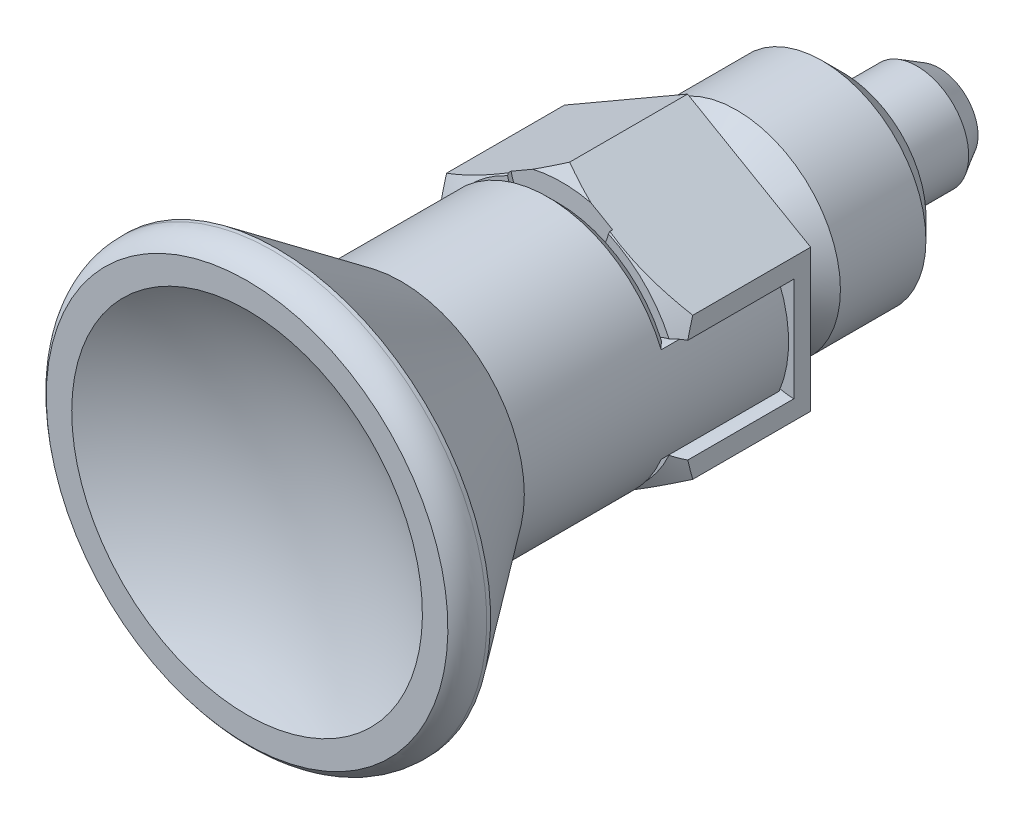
ISO-10303-21;
HEADER;
FILE_DESCRIPTION(('STEP AP214'),'2;1');
FILE_NAME('part.step','',(''),(''),'','','');
FILE_SCHEMA(('AUTOMOTIVE_DESIGN { 1 0 10303 214 1 1 1 1 }'));
ENDSEC;
DATA;
#1=APPLICATION_CONTEXT('core data for automotive mechanical design processes');
#2=APPLICATION_PROTOCOL_DEFINITION('international standard','automotive_design',2000,#1);
#3=PRODUCT_CONTEXT('',#1,'mechanical');
#4=PRODUCT('Part','Part','',(#3));
#5=PRODUCT_RELATED_PRODUCT_CATEGORY('part','',(#4));
#6=PRODUCT_DEFINITION_FORMATION('','',#4);
#7=PRODUCT_DEFINITION_CONTEXT('part definition',#1,'design');
#8=PRODUCT_DEFINITION('design','',#6,#7);
#9=PRODUCT_DEFINITION_SHAPE('','',#8);
#10=(LENGTH_UNIT() NAMED_UNIT(*) SI_UNIT(.MILLI.,.METRE.));
#11=(NAMED_UNIT(*) PLANE_ANGLE_UNIT() SI_UNIT($,.RADIAN.));
#12=(NAMED_UNIT(*) SI_UNIT($,.STERADIAN.) SOLID_ANGLE_UNIT());
#13=UNCERTAINTY_MEASURE_WITH_UNIT(LENGTH_MEASURE(1.E-05),#10,'distance_accuracy_value','');
#14=(GEOMETRIC_REPRESENTATION_CONTEXT(3) GLOBAL_UNCERTAINTY_ASSIGNED_CONTEXT((#13)) GLOBAL_UNIT_ASSIGNED_CONTEXT((#10,
#11,#12)) REPRESENTATION_CONTEXT('',''));
#15=CARTESIAN_POINT('',(0.,0.,0.));
#16=DIRECTION('',(0.,0.,1.));
#17=DIRECTION('',(1.,0.,0.));
#18=AXIS2_PLACEMENT_3D('',#15,#16,#17);
#19=CARTESIAN_POINT('',(0.,0.,-11.9999999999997));
#20=DIRECTION('',(-1.,0.,0.));
#21=DIRECTION('',(0.,1.,0.));
#22=AXIS2_PLACEMENT_3D('',#19,#20,#21);
#23=SPHERICAL_SURFACE('',#22,8.00000000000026);
#24=CARTESIAN_POINT('',(0.,0.,-19.4113534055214));
#25=DIRECTION('',(0.,0.,1.));
#26=DIRECTION('',(-1.,0.,0.));
#27=AXIS2_PLACEMENT_3D('',#24,#25,#26);
#28=CIRCLE('',#27,3.01194965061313);
#29=CARTESIAN_POINT('',(-3.01194965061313,0.,-19.4113534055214));
#30=VERTEX_POINT('',#29);
#31=EDGE_CURVE('E18',#30,#30,#28,.T.);
#32=ORIENTED_EDGE('',*,*,#31,.F.);
#33=EDGE_LOOP('',(#32));
#34=FACE_BOUND('',#33,.T.);
#35=ADVANCED_FACE('F14',(#34),#23,.T.);
#36=CARTESIAN_POINT('',(0.,0.,-17.7000000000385));
#37=DIRECTION('',(0.,0.,1.));
#38=DIRECTION('',(-1.,0.,0.));
#39=AXIS2_PLACEMENT_3D('',#36,#37,#38);
#40=CONICAL_SURFACE('',#39,3.99999999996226,0.523598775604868);
#41=CARTESIAN_POINT('',(0.,0.,-17.7));
#42=DIRECTION('',(0.,0.,1.));
#43=DIRECTION('',(0.,-1.,0.));
#44=AXIS2_PLACEMENT_3D('',#41,#42,#43);
#45=CIRCLE('',#44,4.);
#46=CARTESIAN_POINT('',(0.,-4.,-17.7));
#47=VERTEX_POINT('',#46);
#48=EDGE_CURVE('E890',#47,#47,#45,.T.);
#49=ORIENTED_EDGE('',*,*,#48,.F.);
#50=EDGE_LOOP('',(#49));
#51=FACE_BOUND('',#50,.T.);
#52=ORIENTED_EDGE('',*,*,#31,.T.);
#53=EDGE_LOOP('',(#52));
#54=FACE_BOUND('',#53,.T.);
#55=ADVANCED_FACE('F879',(#51,#54),#40,.T.);
#56=CARTESIAN_POINT('',(0.,0.,-20.));
#57=DIRECTION('',(0.,0.,1.));
#58=DIRECTION('',(0.,-1.,0.));
#59=AXIS2_PLACEMENT_3D('',#56,#57,#58);
#60=CYLINDRICAL_SURFACE('',#59,4.);
#61=CARTESIAN_POINT('',(0.,0.,-12.));
#62=DIRECTION('',(0.,0.,1.));
#63=DIRECTION('',(0.,-1.,0.));
#64=AXIS2_PLACEMENT_3D('',#61,#62,#63);
#65=CIRCLE('',#64,4.);
#66=CARTESIAN_POINT('',(0.,-4.,-12.));
#67=VERTEX_POINT('',#66);
#68=EDGE_CURVE('E893',#67,#67,#65,.F.);
#69=ORIENTED_EDGE('',*,*,#68,.T.);
#70=EDGE_LOOP('',(#69));
#71=FACE_BOUND('',#70,.T.);
#72=ORIENTED_EDGE('',*,*,#48,.T.);
#73=EDGE_LOOP('',(#72));
#74=FACE_BOUND('',#73,.T.);
#75=ADVANCED_FACE('F876',(#71,#74),#60,.T.);
#76=CARTESIAN_POINT('',(6.4,0.,-12.));
#77=DIRECTION('',(0.,0.,1.));
#78=DIRECTION('',(0.,-1.,0.));
#79=AXIS2_PLACEMENT_3D('',#76,#77,#78);
#80=PLANE('',#79);
#81=CARTESIAN_POINT('',(0.,0.,-12.));
#82=DIRECTION('',(0.,0.,1.));
#83=DIRECTION('',(-1.,0.,0.));
#84=AXIS2_PLACEMENT_3D('',#81,#82,#83);
#85=CIRCLE('',#84,6.4);
#86=CARTESIAN_POINT('',(-6.4,0.,-12.));
#87=VERTEX_POINT('',#86);
#88=EDGE_CURVE('E897',#87,#87,#85,.T.);
#89=ORIENTED_EDGE('',*,*,#88,.F.);
#90=EDGE_LOOP('',(#89));
#91=FACE_BOUND('',#90,.T.);
#92=ORIENTED_EDGE('',*,*,#68,.F.);
#93=EDGE_LOOP('',(#92));
#94=FACE_BOUND('',#93,.T.);
#95=ADVANCED_FACE('F872',(#91,#94),#80,.F.);
#96=CARTESIAN_POINT('',(0.,0.,-10.4));
#97=DIRECTION('',(0.,0.,1.));
#98=DIRECTION('',(-1.,0.,0.));
#99=AXIS2_PLACEMENT_3D('',#96,#97,#98);
#100=CONICAL_SURFACE('',#99,8.,0.785398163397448);
#101=CARTESIAN_POINT('',(0.,0.,-10.4));
#102=DIRECTION('',(0.,0.,1.));
#103=DIRECTION('',(0.,-1.,0.));
#104=AXIS2_PLACEMENT_3D('',#101,#102,#103);
#105=CIRCLE('',#104,8.);
#106=CARTESIAN_POINT('',(0.,-8.,-10.4));
#107=VERTEX_POINT('',#106);
#108=EDGE_CURVE('E922',#107,#107,#105,.T.);
#109=ORIENTED_EDGE('',*,*,#108,.F.);
#110=EDGE_LOOP('',(#109));
#111=FACE_BOUND('',#110,.T.);
#112=ORIENTED_EDGE('',*,*,#88,.T.);
#113=EDGE_LOOP('',(#112));
#114=FACE_BOUND('',#113,.T.);
#115=ADVANCED_FACE('F868',(#111,#114),#100,.T.);
#116=CARTESIAN_POINT('',(0.,0.,-12.));
#117=DIRECTION('',(0.,0.,1.));
#118=DIRECTION('',(0.,-1.,0.));
#119=AXIS2_PLACEMENT_3D('',#116,#117,#118);
#120=CYLINDRICAL_SURFACE('',#119,8.);
#121=CARTESIAN_POINT('',(0.,0.,-3.80000000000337));
#122=DIRECTION('',(0.,0.,-1.));
#123=DIRECTION('',(0.,1.,0.));
#124=AXIS2_PLACEMENT_3D('',#121,#122,#123);
#125=CIRCLE('',#124,7.99999999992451);
#126=CARTESIAN_POINT('',(0.,7.99999999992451,-3.80000000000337));
#127=VERTEX_POINT('',#126);
#128=EDGE_CURVE('E925',#127,#127,#125,.F.);
#129=ORIENTED_EDGE('',*,*,#128,.F.);
#130=EDGE_LOOP('',(#129));
#131=FACE_BOUND('',#130,.T.);
#132=ORIENTED_EDGE('',*,*,#108,.T.);
#133=EDGE_LOOP('',(#132));
#134=FACE_BOUND('',#133,.T.);
#135=ADVANCED_FACE('F864',(#131,#134),#120,.T.);
#136=CARTESIAN_POINT('',(0.,0.,-3.80000000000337));
#137=DIRECTION('',(0.,0.,-1.));
#138=DIRECTION('',(0.,1.,0.));
#139=AXIS2_PLACEMENT_3D('',#136,#137,#138);
#140=CONICAL_SURFACE('',#139,7.99999999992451,0.698131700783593);
#141=CARTESIAN_POINT('',(0.,0.,-1.99324858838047));
#142=DIRECTION('',(0.,0.,-1.));
#143=DIRECTION('',(0.,1.,0.));
#144=AXIS2_PLACEMENT_3D('',#141,#142,#143);
#145=CIRCLE('',#144,6.48395555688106);
#146=CARTESIAN_POINT('',(0.,6.48395555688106,-1.99324858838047));
#147=VERTEX_POINT('',#146);
#148=EDGE_CURVE('E851',#147,#147,#145,.T.);
#149=ORIENTED_EDGE('',*,*,#148,.T.);
#150=EDGE_LOOP('',(#149));
#151=FACE_BOUND('',#150,.T.);
#152=ORIENTED_EDGE('',*,*,#128,.T.);
#153=EDGE_LOOP('',(#152));
#154=FACE_BOUND('',#153,.T.);
#155=ADVANCED_FACE('F860',(#151,#154),#140,.T.);
#156=CARTESIAN_POINT('',(0.,0.,-1.3504609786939));
#157=DIRECTION('',(0.,0.,-1.));
#158=DIRECTION('',(0.,1.,0.));
#159=AXIS2_PLACEMENT_3D('',#156,#157,#158);
#160=TOROIDAL_SURFACE('',#159,7.25,0.999999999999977);
#161=CARTESIAN_POINT('',(0.,0.,-1.3504609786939));
#162=DIRECTION('',(0.,0.,1.));
#163=DIRECTION('',(0.,-1.,0.));
#164=AXIS2_PLACEMENT_3D('',#161,#162,#163);
#165=CIRCLE('',#164,6.25);
#166=CARTESIAN_POINT('',(0.,-6.25,-1.3504609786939));
#167=VERTEX_POINT('',#166);
#168=EDGE_CURVE('E843',#167,#167,#165,.T.);
#169=ORIENTED_EDGE('',*,*,#168,.F.);
#170=EDGE_LOOP('',(#169));
#171=FACE_BOUND('',#170,.T.);
#172=ORIENTED_EDGE('',*,*,#148,.F.);
#173=EDGE_LOOP('',(#172));
#174=FACE_BOUND('',#173,.T.);
#175=ADVANCED_FACE('F857',(#171,#174),#160,.F.);
#176=CARTESIAN_POINT('',(0.,0.,-12.));
#177=DIRECTION('',(0.,0.,1.));
#178=DIRECTION('',(0.,-1.,0.));
#179=AXIS2_PLACEMENT_3D('',#176,#177,#178);
#180=CYLINDRICAL_SURFACE('',#179,6.25);
#181=CARTESIAN_POINT('',(0.,0.,-1.));
#182=DIRECTION('',(0.,0.,-1.));
#183=DIRECTION('',(0.,1.,0.));
#184=AXIS2_PLACEMENT_3D('',#181,#182,#183);
#185=CIRCLE('',#184,6.25);
#186=CARTESIAN_POINT('',(0.,6.25,-1.));
#187=VERTEX_POINT('',#186);
#188=EDGE_CURVE('E829',#187,#187,#185,.T.);
#189=ORIENTED_EDGE('',*,*,#188,.T.);
#190=EDGE_LOOP('',(#189));
#191=FACE_BOUND('',#190,.T.);
#192=ORIENTED_EDGE('',*,*,#168,.T.);
#193=EDGE_LOOP('',(#192));
#194=FACE_BOUND('',#193,.T.);
#195=ADVANCED_FACE('F835',(#191,#194),#180,.T.);
#196=CARTESIAN_POINT('',(0.,0.,-1.));
#197=DIRECTION('',(0.,0.,-1.));
#198=DIRECTION('',(0.,1.,0.));
#199=AXIS2_PLACEMENT_3D('',#196,#197,#198);
#200=TOROIDAL_SURFACE('',#199,7.25,1.);
#201=CARTESIAN_POINT('',(0.,0.,0.));
#202=DIRECTION('',(0.,0.,-1.));
#203=DIRECTION('',(0.,1.,0.));
#204=AXIS2_PLACEMENT_3D('',#201,#202,#203);
#205=CIRCLE('',#204,7.25);
#206=CARTESIAN_POINT('',(0.,7.25,0.));
#207=VERTEX_POINT('',#206);
#208=EDGE_CURVE('E276',#207,#207,#205,.T.);
#209=ORIENTED_EDGE('',*,*,#208,.T.);
#210=EDGE_LOOP('',(#209));
#211=FACE_BOUND('',#210,.T.);
#212=ORIENTED_EDGE('',*,*,#188,.F.);
#213=EDGE_LOOP('',(#212));
#214=FACE_BOUND('',#213,.T.);
#215=ADVANCED_FACE('F831',(#211,#214),#200,.F.);
#216=CARTESIAN_POINT('',(0.,0.,9.0964));
#217=DIRECTION('',(0.,0.,-1.));
#218=DIRECTION('',(1.,0.,0.));
#219=AXIS2_PLACEMENT_3D('',#216,#217,#218);
#220=CONICAL_SURFACE('',#219,10.9758904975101,1.0471975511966);
#221=CARTESIAN_POINT('',(0.,10.9696551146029,9.1));
#222=CARTESIAN_POINT('',(0.18469290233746,10.8630226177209,9.1615597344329));
#223=CARTESIAN_POINT('',(0.370018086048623,10.7560250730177,9.22064632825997));
#224=CARTESIAN_POINT('',(0.741777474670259,10.5413896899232,9.3332090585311));
#225=CARTESIAN_POINT('',(0.928210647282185,10.4337524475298,9.38668974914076));
#226=CARTESIAN_POINT('',(1.30235550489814,10.2177398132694,9.48748540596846));
#227=CARTESIAN_POINT('',(1.49006734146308,10.1093643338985,9.53479962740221));
#228=CARTESIAN_POINT('',(1.86683325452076,9.89183843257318,9.62265565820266));
#229=CARTESIAN_POINT('',(2.05588830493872,9.78268744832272,9.66319188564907));
#230=CARTESIAN_POINT('',(2.24550404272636,9.67321275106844,9.7));
#231=B_SPLINE_CURVE_WITH_KNOTS('',3,(#221,#222,#223,#224,#225,#226,#227,#228,#229,#230),
.UNSPECIFIED.,.F.,.F.,(4,2,2,2,4),(0.,0.665923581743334,1.33130191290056,1.99676053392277,
2.66276451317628),.UNSPECIFIED.);
#232=CARTESIAN_POINT('',(0.,10.9696551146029,9.1));
#233=VERTEX_POINT('',#232);
#234=CARTESIAN_POINT('',(2.24550404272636,9.67321275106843,9.7));
#235=VERTEX_POINT('',#234);
#236=EDGE_CURVE('E197',#233,#235,#231,.T.);
#237=ORIENTED_EDGE('',*,*,#236,.F.);
#238=CARTESIAN_POINT('',(-2.24550404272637,9.67321275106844,9.7));
#239=CARTESIAN_POINT('',(-2.05588830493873,9.78268744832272,9.66319188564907));
#240=CARTESIAN_POINT('',(-1.86683325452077,9.89183843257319,9.62265565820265));
#241=CARTESIAN_POINT('',(-1.49006734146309,10.1093643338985,9.53479962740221));
#242=CARTESIAN_POINT('',(-1.30235550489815,10.2177398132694,9.48748540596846));
#243=CARTESIAN_POINT('',(-0.928210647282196,10.4337524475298,9.38668974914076));
#244=CARTESIAN_POINT('',(-0.74177747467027,10.5413896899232,9.33320905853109));
#245=CARTESIAN_POINT('',(-0.370018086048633,10.7560250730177,9.22064632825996));
#246=CARTESIAN_POINT('',(-0.184692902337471,10.8630226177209,9.1615597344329));
#247=CARTESIAN_POINT('',(0.,10.9696551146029,9.1));
#248=B_SPLINE_CURVE_WITH_KNOTS('',3,(#238,#239,#240,#241,#242,#243,#244,#245,#246,#247),
.UNSPECIFIED.,.F.,.F.,(4,2,2,2,4),(0.,0.666003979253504,1.33146260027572,1.99684093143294,
2.66276451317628),.UNSPECIFIED.);
#249=CARTESIAN_POINT('',(-2.24550404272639,9.67321275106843,9.7));
#250=VERTEX_POINT('',#249);
#251=EDGE_CURVE('E261',#250,#233,#248,.T.);
#252=ORIENTED_EDGE('',*,*,#251,.F.);
#253=CARTESIAN_POINT('',(0.,0.,9.7));
#254=DIRECTION('',(0.,0.,-1.));
#255=DIRECTION('',(1.,0.,0.));
#256=AXIS2_PLACEMENT_3D('',#253,#254,#255);
#257=CIRCLE('',#256,9.93042463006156);
#258=EDGE_CURVE('E265',#235,#250,#257,.F.);
#259=ORIENTED_EDGE('',*,*,#258,.F.);
#260=EDGE_LOOP('',(#237,#252,#259));
#261=FACE_BOUND('',#260,.T.);
#262=ADVANCED_FACE('F306',(#261),#220,.T.);
#263=CARTESIAN_POINT('',(0.,0.,9.0964));
#264=DIRECTION('',(0.,0.,-1.));
#265=DIRECTION('',(1.,0.,0.));
#266=AXIS2_PLACEMENT_3D('',#263,#264,#265);
#267=CONICAL_SURFACE('',#266,10.9758904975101,1.0471975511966);
#268=CARTESIAN_POINT('',(0.,-10.9696551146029,9.1));
#269=CARTESIAN_POINT('',(-0.18469290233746,-10.8630226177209,9.1615597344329));
#270=CARTESIAN_POINT('',(-0.370018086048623,-10.7560250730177,9.22064632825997));
#271=CARTESIAN_POINT('',(-0.741777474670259,-10.5413896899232,9.3332090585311));
#272=CARTESIAN_POINT('',(-0.928210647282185,-10.4337524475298,9.38668974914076));
#273=CARTESIAN_POINT('',(-1.30235550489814,-10.2177398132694,9.48748540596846));
#274=CARTESIAN_POINT('',(-1.49006734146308,-10.1093643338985,9.53479962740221));
#275=CARTESIAN_POINT('',(-1.86683325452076,-9.89183843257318,9.62265565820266));
#276=CARTESIAN_POINT('',(-2.05588830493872,-9.78268744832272,9.66319188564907));
#277=CARTESIAN_POINT('',(-2.24550404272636,-9.67321275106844,9.7));
#278=B_SPLINE_CURVE_WITH_KNOTS('',3,(#268,#269,#270,#271,#272,#273,#274,#275,#276,#277),
.UNSPECIFIED.,.F.,.F.,(4,2,2,2,4),(0.,0.665923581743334,1.33130191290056,1.99676053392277,
2.66276451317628),.UNSPECIFIED.);
#279=CARTESIAN_POINT('',(0.,-10.9696551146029,9.1));
#280=VERTEX_POINT('',#279);
#281=CARTESIAN_POINT('',(-2.24550404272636,-9.67321275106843,9.7));
#282=VERTEX_POINT('',#281);
#283=EDGE_CURVE('E241',#280,#282,#278,.T.);
#284=ORIENTED_EDGE('',*,*,#283,.F.);
#285=CARTESIAN_POINT('',(2.24550404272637,-9.67321275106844,9.7));
#286=CARTESIAN_POINT('',(2.05588830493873,-9.78268744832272,9.66319188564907));
#287=CARTESIAN_POINT('',(1.86683325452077,-9.89183843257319,9.62265565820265));
#288=CARTESIAN_POINT('',(1.49006734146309,-10.1093643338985,9.53479962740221));
#289=CARTESIAN_POINT('',(1.30235550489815,-10.2177398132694,9.48748540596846));
#290=CARTESIAN_POINT('',(0.928210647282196,-10.4337524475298,9.38668974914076));
#291=CARTESIAN_POINT('',(0.74177747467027,-10.5413896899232,9.33320905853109));
#292=CARTESIAN_POINT('',(0.370018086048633,-10.7560250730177,9.22064632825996));
#293=CARTESIAN_POINT('',(0.18469290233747,-10.8630226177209,9.1615597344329));
#294=CARTESIAN_POINT('',(0.,-10.9696551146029,9.1));
#295=B_SPLINE_CURVE_WITH_KNOTS('',3,(#285,#286,#287,#288,#289,#290,#291,#292,#293,#294),
.UNSPECIFIED.,.F.,.F.,(4,2,2,2,4),(0.,0.666003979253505,1.33146260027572,1.99684093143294,
2.66276451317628),.UNSPECIFIED.);
#296=CARTESIAN_POINT('',(2.24550404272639,-9.67321275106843,9.7));
#297=VERTEX_POINT('',#296);
#298=EDGE_CURVE('E312',#297,#280,#295,.T.);
#299=ORIENTED_EDGE('',*,*,#298,.F.);
#300=CARTESIAN_POINT('',(0.,0.,9.7));
#301=DIRECTION('',(0.,0.,-1.));
#302=DIRECTION('',(1.,0.,0.));
#303=AXIS2_PLACEMENT_3D('',#300,#301,#302);
#304=CIRCLE('',#303,9.93042463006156);
#305=EDGE_CURVE('E327',#282,#297,#304,.F.);
#306=ORIENTED_EDGE('',*,*,#305,.F.);
#307=EDGE_LOOP('',(#284,#299,#306));
#308=FACE_BOUND('',#307,.T.);
#309=ADVANCED_FACE('F300',(#308),#267,.T.);
#310=CARTESIAN_POINT('',(24.,0.,0.));
#311=DIRECTION('',(0.,0.,1.));
#312=DIRECTION('',(0.,-1.,0.));
#313=AXIS2_PLACEMENT_3D('',#310,#311,#312);
#314=PLANE('',#313);
#315=DIRECTION('',(-0.866025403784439,0.5,0.));
#316=VECTOR('',#315,1.);
#317=CARTESIAN_POINT('',(9.5,5.48482755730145,0.));
#318=LINE('',#317,#316);
#319=CARTESIAN_POINT('',(9.5,5.48482755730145,0.));
#320=VERTEX_POINT('',#319);
#321=CARTESIAN_POINT('',(0.,10.9696551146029,0.));
#322=VERTEX_POINT('',#321);
#323=EDGE_CURVE('E205',#320,#322,#318,.T.);
#324=ORIENTED_EDGE('',*,*,#323,.F.);
#325=DIRECTION('',(0.,1.,0.));
#326=VECTOR('',#325,1.);
#327=CARTESIAN_POINT('',(9.5,-5.48482755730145,0.));
#328=LINE('',#327,#326);
#329=CARTESIAN_POINT('',(9.5,-5.48482755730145,0.));
#330=VERTEX_POINT('',#329);
#331=EDGE_CURVE('E278',#330,#320,#328,.T.);
#332=ORIENTED_EDGE('',*,*,#331,.F.);
#333=DIRECTION('',(0.866025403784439,0.5,0.));
#334=VECTOR('',#333,1.);
#335=CARTESIAN_POINT('',(0.,-10.9696551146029,0.));
#336=LINE('',#335,#334);
#337=CARTESIAN_POINT('',(0.,-10.9696551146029,0.));
#338=VERTEX_POINT('',#337);
#339=EDGE_CURVE('E218',#338,#330,#336,.T.);
#340=ORIENTED_EDGE('',*,*,#339,.F.);
#341=DIRECTION('',(0.866025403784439,-0.5,0.));
#342=VECTOR('',#341,1.);
#343=CARTESIAN_POINT('',(-9.5,-5.48482755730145,0.));
#344=LINE('',#343,#342);
#345=CARTESIAN_POINT('',(-9.5,-5.48482755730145,0.));
#346=VERTEX_POINT('',#345);
#347=EDGE_CURVE('E236',#346,#338,#344,.T.);
#348=ORIENTED_EDGE('',*,*,#347,.F.);
#349=DIRECTION('',(0.,-1.,0.));
#350=VECTOR('',#349,1.);
#351=CARTESIAN_POINT('',(-9.5,5.48482755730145,0.));
#352=LINE('',#351,#350);
#353=CARTESIAN_POINT('',(-9.5,5.48482755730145,0.));
#354=VERTEX_POINT('',#353);
#355=EDGE_CURVE('E226',#354,#346,#352,.T.);
#356=ORIENTED_EDGE('',*,*,#355,.F.);
#357=DIRECTION('',(-0.866025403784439,-0.5,0.));
#358=VECTOR('',#357,1.);
#359=CARTESIAN_POINT('',(0.,10.9696551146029,0.));
#360=LINE('',#359,#358);
#361=EDGE_CURVE('E257',#322,#354,#360,.T.);
#362=ORIENTED_EDGE('',*,*,#361,.F.);
#363=EDGE_LOOP('',(#324,#332,#340,#348,#356,#362));
#364=FACE_BOUND('',#363,.T.);
#365=ORIENTED_EDGE('',*,*,#208,.F.);
#366=EDGE_LOOP('',(#365));
#367=FACE_BOUND('',#366,.T.);
#368=ADVANCED_FACE('F237',(#364,#367),#314,.F.);
#369=CARTESIAN_POINT('',(9.5,5.48482755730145,0.));
#370=DIRECTION('',(0.5,0.866025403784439,0.));
#371=DIRECTION('',(-0.866025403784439,0.5,0.));
#372=AXIS2_PLACEMENT_3D('',#369,#370,#371);
#373=PLANE('',#372);
#374=ORIENTED_EDGE('',*,*,#236,.T.);
#375=DIRECTION('',(-0.866025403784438,0.5,0.));
#376=VECTOR('',#375,1.);
#377=CARTESIAN_POINT('',(3.92044145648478,8.70618718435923,9.7));
#378=LINE('',#377,#376);
#379=CARTESIAN_POINT('',(3.92044145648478,8.70618718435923,9.7));
#380=VERTEX_POINT('',#379);
#381=EDGE_CURVE('E271',#380,#235,#378,.T.);
#382=ORIENTED_EDGE('',*,*,#381,.F.);
#383=DIRECTION('',(0.,0.,1.));
#384=VECTOR('',#383,1.);
#385=CARTESIAN_POINT('',(3.92044145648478,8.70618718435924,0.));
#386=LINE('',#385,#384);
#387=CARTESIAN_POINT('',(3.9204414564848,8.70618718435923,9.92069462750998));
#388=VERTEX_POINT('',#387);
#389=EDGE_CURVE('E274',#380,#388,#386,.T.);
#390=ORIENTED_EDGE('',*,*,#389,.T.);
#391=CARTESIAN_POINT('',(9.50000002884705,5.4848275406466,9.09999999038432));
#392=CARTESIAN_POINT('',(9.04622508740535,5.74681462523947,9.2512603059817));
#393=CARTESIAN_POINT('',(8.58844999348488,6.01111119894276,9.38762213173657));
#394=CARTESIAN_POINT('',(7.89800393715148,6.40974041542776,9.56240380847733));
#395=CARTESIAN_POINT('',(7.66806995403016,6.5424928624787,9.61556382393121));
#396=CARTESIAN_POINT('',(7.20653105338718,6.80896247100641,9.71109829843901));
#397=CARTESIAN_POINT('',(6.97492634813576,6.9426795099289,9.75347410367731));
#398=CARTESIAN_POINT('',(6.50990671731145,7.21115871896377,9.82644724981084));
#399=CARTESIAN_POINT('',(6.27648932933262,7.34592231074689,9.85702380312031));
#400=CARTESIAN_POINT('',(5.80865776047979,7.61602499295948,9.90542973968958));
#401=CARTESIAN_POINT('',(5.57424357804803,7.75136408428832,9.92325910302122));
#402=CARTESIAN_POINT('',(5.10317736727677,8.02333428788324,9.94570442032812));
#403=CARTESIAN_POINT('',(4.86652167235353,8.15996751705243,9.95022100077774));
#404=CARTESIAN_POINT('',(4.51161045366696,8.36487560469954,9.94677181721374));
#405=CARTESIAN_POINT('',(4.39330241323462,8.43318078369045,9.9439169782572));
#406=CARTESIAN_POINT('',(4.15678350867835,8.56973503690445,9.93483032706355));
#407=CARTESIAN_POINT('',(4.03857264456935,8.63798411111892,9.92859851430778));
#408=CARTESIAN_POINT('',(3.92044145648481,8.70618718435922,9.92069462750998));
#409=B_SPLINE_CURVE_WITH_KNOTS('',3,(#391,#392,#393,#394,#395,#396,#397,#398,#399,#400,#401,
#402,#403,#404,#405,#406,#407,#408),.UNSPECIFIED.,.F.,.F.,(4,2,2,2,2,2,2,2,4),(0.,
1.63612557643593,2.44828636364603,3.26034571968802,4.07382927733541,4.88731410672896,
5.70685602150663,6.11674035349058,6.52662474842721),.UNSPECIFIED.);
#410=CARTESIAN_POINT('',(9.50000001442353,5.48482754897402,9.09999999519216));
#411=VERTEX_POINT('',#410);
#412=EDGE_CURVE('E415',#411,#388,#409,.T.);
#413=ORIENTED_EDGE('',*,*,#412,.F.);
#414=DIRECTION('',(0.,0.,1.));
#415=VECTOR('',#414,1.);
#416=CARTESIAN_POINT('',(9.5,5.48482755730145,0.));
#417=LINE('',#416,#415);
#418=EDGE_CURVE('E281',#320,#411,#417,.T.);
#419=ORIENTED_EDGE('',*,*,#418,.F.);
#420=ORIENTED_EDGE('',*,*,#323,.T.);
#421=DIRECTION('',(0.,0.,1.));
#422=VECTOR('',#421,1.);
#423=CARTESIAN_POINT('',(0.,10.9696551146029,0.));
#424=LINE('',#423,#422);
#425=EDGE_CURVE('E258',#233,#322,#424,.F.);
#426=ORIENTED_EDGE('',*,*,#425,.F.);
#427=EDGE_LOOP('',(#374,#382,#390,#413,#419,#420,#426));
#428=FACE_BOUND('',#427,.T.);
#429=ADVANCED_FACE('F299',(#428),#373,.T.);
#430=CARTESIAN_POINT('',(0.,0.,9.7));
#431=DIRECTION('',(0.,0.,1.));
#432=DIRECTION('',(0.,-1.,0.));
#433=AXIS2_PLACEMENT_3D('',#430,#431,#432);
#434=PLANE('',#433);
#435=ORIENTED_EDGE('',*,*,#258,.T.);
#436=DIRECTION('',(-0.866025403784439,-0.5,0.));
#437=VECTOR('',#436,1.);
#438=CARTESIAN_POINT('',(0.,10.9696551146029,9.7));
#439=LINE('',#438,#437);
#440=CARTESIAN_POINT('',(-3.92044145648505,8.70618718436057,9.7));
#441=VERTEX_POINT('',#440);
#442=EDGE_CURVE('E262',#441,#250,#439,.F.);
#443=ORIENTED_EDGE('',*,*,#442,.F.);
#444=CARTESIAN_POINT('',(0.,9.5,9.7));
#445=DIRECTION('',(0.,0.,-1.));
#446=DIRECTION('',(0.,1.,0.));
#447=AXIS2_PLACEMENT_3D('',#444,#445,#446);
#448=CIRCLE('',#447,4.);
#449=EDGE_CURVE('E422',#441,#380,#448,.F.);
#450=ORIENTED_EDGE('',*,*,#449,.T.);
#451=ORIENTED_EDGE('',*,*,#381,.T.);
#452=EDGE_LOOP('',(#435,#443,#450,#451));
#453=FACE_BOUND('',#452,.T.);
#454=ADVANCED_FACE('F954',(#453),#434,.T.);
#455=CARTESIAN_POINT('',(0.,10.9696551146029,0.));
#456=DIRECTION('',(-0.5,0.866025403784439,0.));
#457=DIRECTION('',(-0.866025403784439,-0.5,0.));
#458=AXIS2_PLACEMENT_3D('',#455,#456,#457);
#459=PLANE('',#458);
#460=DIRECTION('',(0.,0.,1.));
#461=VECTOR('',#460,1.);
#462=CARTESIAN_POINT('',(-9.5,5.48482755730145,0.));
#463=LINE('',#462,#461);
#464=CARTESIAN_POINT('',(-9.5,5.48482751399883,9.10000001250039));
#465=VERTEX_POINT('',#464);
#466=EDGE_CURVE('E233',#465,#354,#463,.F.);
#467=ORIENTED_EDGE('',*,*,#466,.F.);
#468=CARTESIAN_POINT('',(-3.92044150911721,8.7061871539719,9.9206946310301));
#469=CARTESIAN_POINT('',(-4.10870648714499,8.59749231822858,9.93331697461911));
#470=CARTESIAN_POINT('',(-4.29718780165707,8.48867258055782,9.94164989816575));
#471=CARTESIAN_POINT('',(-4.67427545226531,8.27096092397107,9.94970404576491));
#472=CARTESIAN_POINT('',(-4.86288177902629,8.16206901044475,9.94942585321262));
#473=CARTESIAN_POINT('',(-5.23969345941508,7.94451668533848,9.94023257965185));
#474=CARTESIAN_POINT('',(-5.42789901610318,7.83585615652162,9.93132867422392));
#475=CARTESIAN_POINT('',(-5.80385983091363,7.61879507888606,9.90509696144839));
#476=CARTESIAN_POINT('',(-5.99161508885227,7.51039453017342,9.88776915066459));
#477=CARTESIAN_POINT('',(-6.5500250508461,7.18799638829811,9.82404582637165));
#478=CARTESIAN_POINT('',(-6.91969728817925,6.97456602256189,9.76580305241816));
#479=CARTESIAN_POINT('',(-7.65486705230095,6.55011556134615,9.62139008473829));
#480=CARTESIAN_POINT('',(-8.02036420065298,6.33909568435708,9.5352173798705));
#481=CARTESIAN_POINT('',(-8.47699375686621,6.07546048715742,9.41223505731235));
#482=CARTESIAN_POINT('',(-8.57039552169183,6.02153495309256,9.38626496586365));
#483=CARTESIAN_POINT('',(-8.75686970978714,5.91387403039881,9.33286274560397));
#484=CARTESIAN_POINT('',(-8.84994218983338,5.86013860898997,9.30543088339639));
#485=CARTESIAN_POINT('',(-9.0360225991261,5.75270503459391,9.2491025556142));
#486=CARTESIAN_POINT('',(-9.12902967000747,5.69900737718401,9.2202023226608));
#487=CARTESIAN_POINT('',(-9.31474332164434,5.59178555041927,9.16107598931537));
#488=CARTESIAN_POINT('',(-9.40744985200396,5.53826141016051,9.13084967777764));
#489=CARTESIAN_POINT('',(-9.50000002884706,5.4848275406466,9.09999999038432));
#490=B_SPLINE_CURVE_WITH_KNOTS('',3,(#468,#469,#470,#471,#472,#473,#474,#475,#476,#477,#478,
#479,#480,#481,#482,#483,#484,#485,#486,#487,#488,#489),.UNSPECIFIED.,.F.,.F.,(4,2,2,2,2,2,2,2,
2,2,4),(0.,0.653226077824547,1.30640790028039,1.95874458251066,2.61108153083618,
3.90236938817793,5.19377337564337,5.52657171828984,5.85930957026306,6.1929490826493,
6.52664191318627),.UNSPECIFIED.);
#491=CARTESIAN_POINT('',(-3.92044148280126,8.7061871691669,9.92069462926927));
#492=VERTEX_POINT('',#491);
#493=EDGE_CURVE('E447',#492,#465,#490,.T.);
#494=ORIENTED_EDGE('',*,*,#493,.F.);
#495=DIRECTION('',(0.,0.,-1.));
#496=VECTOR('',#495,1.);
#497=CARTESIAN_POINT('',(-3.92044145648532,8.7061871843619,9.7));
#498=LINE('',#497,#496);
#499=EDGE_CURVE('E266',#492,#441,#498,.T.);
#500=ORIENTED_EDGE('',*,*,#499,.T.);
#501=ORIENTED_EDGE('',*,*,#442,.T.);
#502=ORIENTED_EDGE('',*,*,#251,.T.);
#503=ORIENTED_EDGE('',*,*,#425,.T.);
#504=ORIENTED_EDGE('',*,*,#361,.T.);
#505=EDGE_LOOP('',(#467,#494,#500,#501,#502,#503,#504));
#506=FACE_BOUND('',#505,.T.);
#507=ADVANCED_FACE('F823',(#506),#459,.T.);
#508=CARTESIAN_POINT('',(0.,0.,1.3));
#509=DIRECTION('',(0.,0.,1.));
#510=DIRECTION('',(0.,-1.,0.));
#511=AXIS2_PLACEMENT_3D('',#508,#509,#510);
#512=PLANE('',#511);
#513=CARTESIAN_POINT('',(-9.5,0.,1.3));
#514=DIRECTION('',(0.,0.,-1.));
#515=DIRECTION('',(0.,1.,0.));
#516=AXIS2_PLACEMENT_3D('',#513,#514,#515);
#517=CIRCLE('',#516,4.);
#518=CARTESIAN_POINT('',(-9.5,-4.,1.3));
#519=VERTEX_POINT('',#518);
#520=CARTESIAN_POINT('',(-9.5,4.,1.3));
#521=VERTEX_POINT('',#520);
#522=EDGE_CURVE('E475',#519,#521,#517,.F.);
#523=ORIENTED_EDGE('',*,*,#522,.T.);
#524=DIRECTION('',(0.,-1.,0.));
#525=VECTOR('',#524,1.);
#526=CARTESIAN_POINT('',(-9.5,5.48482755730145,1.3));
#527=LINE('',#526,#525);
#528=EDGE_CURVE('E254',#519,#521,#527,.F.);
#529=ORIENTED_EDGE('',*,*,#528,.F.);
#530=EDGE_LOOP('',(#523,#529));
#531=FACE_BOUND('',#530,.T.);
#532=ADVANCED_FACE('F953',(#531),#512,.T.);
#533=CARTESIAN_POINT('',(-9.5,5.48482755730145,0.));
#534=DIRECTION('',(-1.,0.,0.));
#535=DIRECTION('',(0.,-1.,0.));
#536=AXIS2_PLACEMENT_3D('',#533,#534,#535);
#537=PLANE('',#536);
#538=DIRECTION('',(0.,0.,1.));
#539=VECTOR('',#538,1.);
#540=CARTESIAN_POINT('',(-9.5,-5.48482755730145,0.));
#541=LINE('',#540,#539);
#542=CARTESIAN_POINT('',(-9.5,-5.48482755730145,9.1));
#543=VERTEX_POINT('',#542);
#544=EDGE_CURVE('E230',#543,#346,#541,.F.);
#545=ORIENTED_EDGE('',*,*,#544,.F.);
#546=CARTESIAN_POINT('',(-9.5,-5.48482755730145,9.1));
#547=CARTESIAN_POINT('',(-9.5,-5.36204140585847,9.13544472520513));
#548=CARTESIAN_POINT('',(-9.5,-5.23901614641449,9.17006695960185));
#549=CARTESIAN_POINT('',(-9.5,-4.9925126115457,9.23754435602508));
#550=CARTESIAN_POINT('',(-9.5,-4.86903444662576,9.27039992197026));
#551=CARTESIAN_POINT('',(-9.5,-4.62159131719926,9.33423894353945));
#552=CARTESIAN_POINT('',(-9.5,-4.49762634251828,9.36522235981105));
#553=CARTESIAN_POINT('',(-9.5,-4.2491872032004,9.42520389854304));
#554=CARTESIAN_POINT('',(-9.5,-4.12471292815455,9.45420156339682));
#555=CARTESIAN_POINT('',(-9.5,-3.99999999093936,9.48214297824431));
#556=B_SPLINE_CURVE_WITH_KNOTS('',3,(#546,#547,#548,#549,#550,#551,#552,#553,#554,#555),
.UNSPECIFIED.,.F.,.F.,(4,2,2,2,4),(0.,0.383398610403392,0.766709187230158,1.15002781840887,
1.53343448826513),.UNSPECIFIED.);
#557=CARTESIAN_POINT('',(-9.5,-3.99999999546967,9.48214297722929));
#558=VERTEX_POINT('',#557);
#559=EDGE_CURVE('E234',#543,#558,#556,.T.);
#560=ORIENTED_EDGE('',*,*,#559,.T.);
#561=DIRECTION('',(0.,0.,-1.));
#562=VECTOR('',#561,1.);
#563=CARTESIAN_POINT('',(-9.5,-4.,1.3));
#564=LINE('',#563,#562);
#565=EDGE_CURVE('E481',#558,#519,#564,.T.);
#566=ORIENTED_EDGE('',*,*,#565,.T.);
#567=ORIENTED_EDGE('',*,*,#528,.T.);
#568=DIRECTION('',(0.,0.,-1.));
#569=VECTOR('',#568,1.);
#570=CARTESIAN_POINT('',(-9.5,4.,1.3));
#571=LINE('',#570,#569);
#572=CARTESIAN_POINT('',(-9.5,4.00000001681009,9.48214297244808));
#573=VERTEX_POINT('',#572);
#574=EDGE_CURVE('E469',#521,#573,#571,.F.);
#575=ORIENTED_EDGE('',*,*,#574,.T.);
#576=CARTESIAN_POINT('',(-9.5,5.48482747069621,9.10000002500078));
#577=CARTESIAN_POINT('',(-9.5,5.36204132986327,9.13544474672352));
#578=CARTESIAN_POINT('',(-9.5,5.2390160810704,9.17006697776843));
#579=CARTESIAN_POINT('',(-9.5,4.99251256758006,9.23754436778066));
#580=CARTESIAN_POINT('',(-9.5,4.86903441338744,9.27039993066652));
#581=CARTESIAN_POINT('',(-9.5,4.62159130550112,9.33423894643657));
#582=CARTESIAN_POINT('',(-9.5,4.49762634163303,9.36522235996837));
#583=CARTESIAN_POINT('',(-9.5,4.24918722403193,9.42520389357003));
#584=CARTESIAN_POINT('',(-9.5,4.12471295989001,9.45420155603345));
#585=CARTESIAN_POINT('',(-9.5,4.00000003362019,9.48214296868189));
#586=B_SPLINE_CURVE_WITH_KNOTS('',3,(#576,#577,#578,#579,#580,#581,#582,#583,#584,#585),
.UNSPECIFIED.,.F.,.F.,(4,2,2,2,4),(0.,0.383398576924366,0.766709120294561,1.15002771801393,
1.53343435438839),.UNSPECIFIED.);
#587=EDGE_CURVE('E269',#465,#573,#586,.T.);
#588=ORIENTED_EDGE('',*,*,#587,.F.);
#589=ORIENTED_EDGE('',*,*,#466,.T.);
#590=ORIENTED_EDGE('',*,*,#355,.T.);
#591=EDGE_LOOP('',(#545,#560,#566,#567,#575,#588,#589,#590));
#592=FACE_BOUND('',#591,.T.);
#593=ADVANCED_FACE('F228',(#592),#537,.T.);
#594=CARTESIAN_POINT('',(-9.5,-5.48482755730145,0.));
#595=DIRECTION('',(-0.5,-0.866025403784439,0.));
#596=DIRECTION('',(0.866025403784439,-0.5,0.));
#597=AXIS2_PLACEMENT_3D('',#594,#595,#596);
#598=PLANE('',#597);
#599=ORIENTED_EDGE('',*,*,#283,.T.);
#600=DIRECTION('',(0.866025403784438,-0.5,0.));
#601=VECTOR('',#600,1.);
#602=CARTESIAN_POINT('',(-3.92044145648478,-8.70618718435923,9.7));
#603=LINE('',#602,#601);
#604=CARTESIAN_POINT('',(-3.92044145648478,-8.70618718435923,9.7));
#605=VERTEX_POINT('',#604);
#606=EDGE_CURVE('E250',#605,#282,#603,.T.);
#607=ORIENTED_EDGE('',*,*,#606,.F.);
#608=DIRECTION('',(0.,0.,1.));
#609=VECTOR('',#608,1.);
#610=CARTESIAN_POINT('',(-3.92044145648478,-8.70618718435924,0.));
#611=LINE('',#610,#609);
#612=CARTESIAN_POINT('',(-3.9204414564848,-8.70618718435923,9.92069462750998));
#613=VERTEX_POINT('',#612);
#614=EDGE_CURVE('E246',#605,#613,#611,.T.);
#615=ORIENTED_EDGE('',*,*,#614,.T.);
#616=CARTESIAN_POINT('',(-9.5,-5.48482755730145,9.1));
#617=CARTESIAN_POINT('',(-9.04622506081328,-5.74681464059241,9.25126031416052));
#618=CARTESIAN_POINT('',(-8.5884499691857,-6.01111121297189,9.38762213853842));
#619=CARTESIAN_POINT('',(-7.89800391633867,-6.40974042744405,9.56240381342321));
#620=CARTESIAN_POINT('',(-7.66806993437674,-6.54249287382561,9.61556382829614));
#621=CARTESIAN_POINT('',(-7.20653103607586,-6.8089624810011,9.71109830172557));
#622=CARTESIAN_POINT('',(-6.97492633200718,-6.94267951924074,9.75347410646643));
#623=CARTESIAN_POINT('',(-6.50990670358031,-7.21115872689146,9.8264472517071));
#624=CARTESIAN_POINT('',(-6.27648931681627,-7.34592231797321,9.85702380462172));
#625=CARTESIAN_POINT('',(-5.80865775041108,-7.61602499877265,9.90542974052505));
#626=CARTESIAN_POINT('',(-5.57424356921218,-7.7513640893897,9.9232591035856));
#627=CARTESIAN_POINT('',(-5.10317736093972,-8.02333429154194,9.94570442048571));
#628=CARTESIAN_POINT('',(-4.86652166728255,-8.15996751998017,9.95022100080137));
#629=CARTESIAN_POINT('',(-4.51161045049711,-8.36487560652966,9.94677181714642));
#630=CARTESIAN_POINT('',(-4.39330241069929,-8.43318078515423,9.94391697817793));
#631=CARTESIAN_POINT('',(-4.15678350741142,-8.56973503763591,9.93483032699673));
#632=CARTESIAN_POINT('',(-4.0385726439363,-8.63798411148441,9.92859851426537));
#633=CARTESIAN_POINT('',(-3.9204414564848,-8.70618718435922,9.92069462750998));
#634=B_SPLINE_CURVE_WITH_KNOTS('',3,(#616,#617,#618,#619,#620,#621,#622,#623,#624,#625,#626,
#627,#628,#629,#630,#631,#632,#633),.UNSPECIFIED.,.F.,.F.,(4,2,2,2,2,2,2,2,4),(0.,
1.63612556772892,2.44828635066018,3.26034570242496,4.07382925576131,4.88731408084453,
5.70685599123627,6.11674032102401,6.52662471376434),.UNSPECIFIED.);
#635=EDGE_CURVE('E245',#543,#613,#634,.T.);
#636=ORIENTED_EDGE('',*,*,#635,.F.);
#637=ORIENTED_EDGE('',*,*,#544,.T.);
#638=ORIENTED_EDGE('',*,*,#347,.T.);
#639=DIRECTION('',(0.,0.,1.));
#640=VECTOR('',#639,1.);
#641=CARTESIAN_POINT('',(0.,-10.9696551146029,0.));
#642=LINE('',#641,#640);
#643=EDGE_CURVE('E494',#280,#338,#642,.F.);
#644=ORIENTED_EDGE('',*,*,#643,.F.);
#645=EDGE_LOOP('',(#599,#607,#615,#636,#637,#638,#644));
#646=FACE_BOUND('',#645,.T.);
#647=ADVANCED_FACE('F243',(#646),#598,.T.);
#648=CARTESIAN_POINT('',(0.,0.,9.7));
#649=DIRECTION('',(0.,0.,1.));
#650=DIRECTION('',(0.,-1.,0.));
#651=AXIS2_PLACEMENT_3D('',#648,#649,#650);
#652=PLANE('',#651);
#653=ORIENTED_EDGE('',*,*,#305,.T.);
#654=DIRECTION('',(0.866025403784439,0.5,0.));
#655=VECTOR('',#654,1.);
#656=CARTESIAN_POINT('',(0.,-10.9696551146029,9.7));
#657=LINE('',#656,#655);
#658=CARTESIAN_POINT('',(3.92044145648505,-8.70618718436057,9.7));
#659=VERTEX_POINT('',#658);
#660=EDGE_CURVE('E496',#659,#297,#657,.F.);
#661=ORIENTED_EDGE('',*,*,#660,.F.);
#662=CARTESIAN_POINT('',(0.,-9.5,9.7));
#663=DIRECTION('',(0.,0.,-1.));
#664=DIRECTION('',(0.,1.,0.));
#665=AXIS2_PLACEMENT_3D('',#662,#663,#664);
#666=CIRCLE('',#665,4.);
#667=EDGE_CURVE('E349',#659,#605,#666,.F.);
#668=ORIENTED_EDGE('',*,*,#667,.T.);
#669=ORIENTED_EDGE('',*,*,#606,.T.);
#670=EDGE_LOOP('',(#653,#661,#668,#669));
#671=FACE_BOUND('',#670,.T.);
#672=ADVANCED_FACE('F338',(#671),#652,.T.);
#673=CARTESIAN_POINT('',(0.,-10.9696551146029,0.));
#674=DIRECTION('',(0.5,-0.866025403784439,0.));
#675=DIRECTION('',(0.866025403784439,0.5,0.));
#676=AXIS2_PLACEMENT_3D('',#673,#674,#675);
#677=PLANE('',#676);
#678=DIRECTION('',(0.,0.,1.));
#679=VECTOR('',#678,1.);
#680=CARTESIAN_POINT('',(9.5,-5.48482755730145,0.));
#681=LINE('',#680,#679);
#682=CARTESIAN_POINT('',(9.5,-5.48482751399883,9.10000001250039));
#683=VERTEX_POINT('',#682);
#684=EDGE_CURVE('E282',#683,#330,#681,.F.);
#685=ORIENTED_EDGE('',*,*,#684,.F.);
#686=CARTESIAN_POINT('',(3.92044150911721,-8.7061871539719,9.9206946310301));
#687=CARTESIAN_POINT('',(4.10870648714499,-8.59749231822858,9.93331697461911));
#688=CARTESIAN_POINT('',(4.29718780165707,-8.48867258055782,9.94164989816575));
#689=CARTESIAN_POINT('',(4.67427545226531,-8.27096092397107,9.94970404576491));
#690=CARTESIAN_POINT('',(4.86288177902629,-8.16206901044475,9.94942585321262));
#691=CARTESIAN_POINT('',(5.23969345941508,-7.94451668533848,9.94023257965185));
#692=CARTESIAN_POINT('',(5.42789901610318,-7.83585615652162,9.93132867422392));
#693=CARTESIAN_POINT('',(5.80385983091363,-7.61879507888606,9.90509696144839));
#694=CARTESIAN_POINT('',(5.99161508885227,-7.51039453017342,9.88776915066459));
#695=CARTESIAN_POINT('',(6.5500250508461,-7.18799638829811,9.82404582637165));
#696=CARTESIAN_POINT('',(6.91969728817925,-6.97456602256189,9.76580305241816));
#697=CARTESIAN_POINT('',(7.65486705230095,-6.55011556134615,9.62139008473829));
#698=CARTESIAN_POINT('',(8.02036420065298,-6.33909568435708,9.5352173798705));
#699=CARTESIAN_POINT('',(8.47699375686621,-6.07546048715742,9.41223505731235));
#700=CARTESIAN_POINT('',(8.57039552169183,-6.02153495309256,9.38626496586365));
#701=CARTESIAN_POINT('',(8.75686970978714,-5.91387403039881,9.33286274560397));
#702=CARTESIAN_POINT('',(8.84994218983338,-5.86013860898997,9.30543088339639));
#703=CARTESIAN_POINT('',(9.0360225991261,-5.75270503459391,9.2491025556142));
#704=CARTESIAN_POINT('',(9.12902967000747,-5.69900737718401,9.2202023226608));
#705=CARTESIAN_POINT('',(9.31474332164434,-5.59178555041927,9.16107598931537));
#706=CARTESIAN_POINT('',(9.40744985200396,-5.53826141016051,9.13084967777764));
#707=CARTESIAN_POINT('',(9.50000002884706,-5.4848275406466,9.09999999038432));
#708=B_SPLINE_CURVE_WITH_KNOTS('',3,(#686,#687,#688,#689,#690,#691,#692,#693,#694,#695,#696,
#697,#698,#699,#700,#701,#702,#703,#704,#705,#706,#707),.UNSPECIFIED.,.F.,.F.,(4,2,2,2,2,2,2,2,
2,2,4),(0.,0.653226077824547,1.30640790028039,1.95874458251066,2.61108153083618,
3.90236938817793,5.19377337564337,5.52657171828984,5.85930957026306,6.1929490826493,
6.52664191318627),.UNSPECIFIED.);
#709=CARTESIAN_POINT('',(3.92044148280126,-8.7061871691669,9.92069462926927));
#710=VERTEX_POINT('',#709);
#711=EDGE_CURVE('E504',#710,#683,#708,.T.);
#712=ORIENTED_EDGE('',*,*,#711,.F.);
#713=DIRECTION('',(0.,0.,-1.));
#714=VECTOR('',#713,1.);
#715=CARTESIAN_POINT('',(3.92044145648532,-8.7061871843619,9.7));
#716=LINE('',#715,#714);
#717=EDGE_CURVE('E380',#710,#659,#716,.T.);
#718=ORIENTED_EDGE('',*,*,#717,.T.);
#719=ORIENTED_EDGE('',*,*,#660,.T.);
#720=ORIENTED_EDGE('',*,*,#298,.T.);
#721=ORIENTED_EDGE('',*,*,#643,.T.);
#722=ORIENTED_EDGE('',*,*,#339,.T.);
#723=EDGE_LOOP('',(#685,#712,#718,#719,#720,#721,#722));
#724=FACE_BOUND('',#723,.T.);
#725=ADVANCED_FACE('F501',(#724),#677,.T.);
#726=CARTESIAN_POINT('',(0.,0.,1.3));
#727=DIRECTION('',(0.,0.,1.));
#728=DIRECTION('',(0.,-1.,0.));
#729=AXIS2_PLACEMENT_3D('',#726,#727,#728);
#730=PLANE('',#729);
#731=CARTESIAN_POINT('',(9.5,0.,1.3));
#732=DIRECTION('',(0.,0.,-1.));
#733=DIRECTION('',(0.,1.,0.));
#734=AXIS2_PLACEMENT_3D('',#731,#732,#733);
#735=CIRCLE('',#734,4.);
#736=CARTESIAN_POINT('',(9.5,4.,1.3));
#737=VERTEX_POINT('',#736);
#738=CARTESIAN_POINT('',(9.5,-4.,1.3));
#739=VERTEX_POINT('',#738);
#740=EDGE_CURVE('E553',#737,#739,#735,.F.);
#741=ORIENTED_EDGE('',*,*,#740,.T.);
#742=DIRECTION('',(0.,1.,0.));
#743=VECTOR('',#742,1.);
#744=CARTESIAN_POINT('',(9.5,-5.48482755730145,1.3));
#745=LINE('',#744,#743);
#746=EDGE_CURVE('E491',#737,#739,#745,.F.);
#747=ORIENTED_EDGE('',*,*,#746,.F.);
#748=EDGE_LOOP('',(#741,#747));
#749=FACE_BOUND('',#748,.T.);
#750=ADVANCED_FACE('F403',(#749),#730,.T.);
#751=CARTESIAN_POINT('',(9.5,-5.48482755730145,0.));
#752=DIRECTION('',(1.,0.,0.));
#753=DIRECTION('',(0.,1.,0.));
#754=AXIS2_PLACEMENT_3D('',#751,#752,#753);
#755=PLANE('',#754);
#756=ORIENTED_EDGE('',*,*,#418,.T.);
#757=CARTESIAN_POINT('',(9.5,4.,9.4821429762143));
#758=CARTESIAN_POINT('',(9.5,4.12471292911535,9.45420156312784));
#759=CARTESIAN_POINT('',(9.5,4.24918719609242,9.42520390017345));
#760=CARTESIAN_POINT('',(9.5,4.49762631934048,9.36522236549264));
#761=CARTESIAN_POINT('',(9.5,4.62159128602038,9.3342389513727));
#762=CARTESIAN_POINT('',(9.5,4.86903439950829,9.27039993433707));
#763=CARTESIAN_POINT('',(9.5,4.99251255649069,9.23754437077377));
#764=CARTESIAN_POINT('',(9.5,5.23901607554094,9.17006697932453));
#765=CARTESIAN_POINT('',(9.5,5.36204132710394,9.13544474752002));
#766=CARTESIAN_POINT('',(9.5,5.48482747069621,9.10000002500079));
#767=B_SPLINE_CURVE_WITH_KNOTS('',3,(#757,#758,#759,#760,#761,#762,#763,#764,#765,#766),
.UNSPECIFIED.,.F.,.F.,(4,2,2,2,4),(0.,0.38340664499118,0.76672525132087,1.15003580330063,
1.53343438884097),.UNSPECIFIED.);
#768=CARTESIAN_POINT('',(9.5,4.,9.4821429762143));
#769=VERTEX_POINT('',#768);
#770=EDGE_CURVE('E408',#769,#411,#767,.T.);
#771=ORIENTED_EDGE('',*,*,#770,.F.);
#772=DIRECTION('',(0.,0.,-1.));
#773=VECTOR('',#772,1.);
#774=CARTESIAN_POINT('',(9.5,4.,1.3));
#775=LINE('',#774,#773);
#776=EDGE_CURVE('E555',#769,#737,#775,.T.);
#777=ORIENTED_EDGE('',*,*,#776,.T.);
#778=ORIENTED_EDGE('',*,*,#746,.T.);
#779=DIRECTION('',(0.,0.,-1.));
#780=VECTOR('',#779,1.);
#781=CARTESIAN_POINT('',(9.5,-4.,1.3));
#782=LINE('',#781,#780);
#783=CARTESIAN_POINT('',(9.5,-4.00000001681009,9.48214297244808));
#784=VERTEX_POINT('',#783);
#785=EDGE_CURVE('E552',#739,#784,#782,.F.);
#786=ORIENTED_EDGE('',*,*,#785,.T.);
#787=CARTESIAN_POINT('',(9.5,-5.48482747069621,9.10000002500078));
#788=CARTESIAN_POINT('',(9.5,-5.36204132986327,9.13544474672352));
#789=CARTESIAN_POINT('',(9.5,-5.2390160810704,9.17006697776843));
#790=CARTESIAN_POINT('',(9.5,-4.99251256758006,9.23754436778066));
#791=CARTESIAN_POINT('',(9.5,-4.86903441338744,9.27039993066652));
#792=CARTESIAN_POINT('',(9.5,-4.62159130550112,9.33423894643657));
#793=CARTESIAN_POINT('',(9.5,-4.49762634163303,9.36522235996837));
#794=CARTESIAN_POINT('',(9.5,-4.24918722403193,9.42520389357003));
#795=CARTESIAN_POINT('',(9.5,-4.12471295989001,9.45420155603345));
#796=CARTESIAN_POINT('',(9.5,-4.00000003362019,9.48214296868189));
#797=B_SPLINE_CURVE_WITH_KNOTS('',3,(#787,#788,#789,#790,#791,#792,#793,#794,#795,#796),
.UNSPECIFIED.,.F.,.F.,(4,2,2,2,4),(0.,0.383398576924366,0.766709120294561,1.15002771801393,
1.53343435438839),.UNSPECIFIED.);
#798=EDGE_CURVE('E381',#683,#784,#797,.T.);
#799=ORIENTED_EDGE('',*,*,#798,.F.);
#800=ORIENTED_EDGE('',*,*,#684,.T.);
#801=ORIENTED_EDGE('',*,*,#331,.T.);
#802=EDGE_LOOP('',(#756,#771,#777,#778,#786,#799,#800,#801));
#803=FACE_BOUND('',#802,.T.);
#804=ADVANCED_FACE('F397',(#803),#755,.T.);
#805=CARTESIAN_POINT('',(0.,0.,9.0946));
#806=DIRECTION('',(0.,0.,-1.));
#807=DIRECTION('',(0.,1.,0.));
#808=AXIS2_PLACEMENT_3D('',#805,#806,#807);
#809=CONICAL_SURFACE('',#808,10.9790081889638,1.0471975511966);
#810=ORIENTED_EDGE('',*,*,#412,.T.);
#811=CARTESIAN_POINT('',(3.92044145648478,8.70618718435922,9.92069462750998));
#812=CARTESIAN_POINT('',(3.9157939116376,8.68323597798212,9.93387841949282));
#813=CARTESIAN_POINT('',(3.910948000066,8.66033834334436,9.94707909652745));
#814=CARTESIAN_POINT('',(3.90085944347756,8.61465021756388,9.97351422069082));
#815=CARTESIAN_POINT('',(3.89561679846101,8.59185972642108,9.98674866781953));
#816=CARTESIAN_POINT('',(3.89017578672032,8.56912280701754,10.));
#817=B_SPLINE_CURVE_WITH_KNOTS('',3,(#811,#812,#813,#814,#815,#816),.UNSPECIFIED.,.F.,.F.,(4,2,
4),(0.,0.0806125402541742,0.161225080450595),.UNSPECIFIED.);
#818=CARTESIAN_POINT('',(3.89017578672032,8.56912280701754,10.));
#819=VERTEX_POINT('',#818);
#820=EDGE_CURVE('E425',#388,#819,#817,.T.);
#821=ORIENTED_EDGE('',*,*,#820,.T.);
#822=CARTESIAN_POINT('',(0.,0.,10.));
#823=DIRECTION('',(0.,0.,-1.));
#824=DIRECTION('',(0.,1.,0.));
#825=AXIS2_PLACEMENT_3D('',#822,#823,#824);
#826=CIRCLE('',#825,9.4108093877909);
#827=CARTESIAN_POINT('',(8.56912280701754,3.89017578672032,10.));
#828=VERTEX_POINT('',#827);
#829=EDGE_CURVE('E547',#819,#828,#826,.T.);
#830=ORIENTED_EDGE('',*,*,#829,.T.);
#831=CARTESIAN_POINT('',(8.56912280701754,3.89017578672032,10.));
#832=CARTESIAN_POINT('',(8.64486111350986,3.90829997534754,9.95585666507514));
#833=CARTESIAN_POINT('',(8.72122747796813,3.92423424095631,9.91188800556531));
#834=CARTESIAN_POINT('',(8.87479760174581,3.95160568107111,9.82450533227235));
#835=CARTESIAN_POINT('',(8.95199856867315,3.96305479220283,9.78109014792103));
#836=CARTESIAN_POINT('',(9.10722845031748,3.98143677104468,9.69478159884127));
#837=CARTESIAN_POINT('',(9.185257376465,3.98836957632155,9.65188824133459));
#838=CARTESIAN_POINT('',(9.34212695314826,3.9976578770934,9.56659395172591));
#839=CARTESIAN_POINT('',(9.42096922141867,4.00000102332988,9.52419465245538));
#840=CARTESIAN_POINT('',(9.5,4.,9.4821429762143));
#841=B_SPLINE_CURVE_WITH_KNOTS('',3,(#831,#832,#833,#834,#835,#836,#837,#838,#839,#840),
.UNSPECIFIED.,.F.,.F.,(4,2,2,2,4),(0.,0.268526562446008,0.536333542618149,0.80414422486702,
1.07267451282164),.UNSPECIFIED.);
#842=EDGE_CURVE('E556',#828,#769,#841,.T.);
#843=ORIENTED_EDGE('',*,*,#842,.T.);
#844=ORIENTED_EDGE('',*,*,#770,.T.);
#845=EDGE_LOOP('',(#810,#821,#830,#843,#844));
#846=FACE_BOUND('',#845,.T.);
#847=ADVANCED_FACE('F402',(#846),#809,.T.);
#848=CARTESIAN_POINT('',(0.,9.5,9.7));
#849=DIRECTION('',(0.,0.,-1.));
#850=DIRECTION('',(0.,1.,0.));
#851=AXIS2_PLACEMENT_3D('',#848,#849,#850);
#852=CYLINDRICAL_SURFACE('',#851,4.);
#853=CARTESIAN_POINT('',(-3.89017578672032,8.56912280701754,10.));
#854=CARTESIAN_POINT('',(-3.89561679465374,8.59185971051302,9.98674867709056));
#855=CARTESIAN_POINT('',(-3.90085943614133,8.61465018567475,9.9735142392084));
#856=CARTESIAN_POINT('',(-3.91094798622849,8.66033827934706,9.94707913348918));
#857=CARTESIAN_POINT('',(-3.91579389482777,8.68323589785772,9.93387846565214));
#858=CARTESIAN_POINT('',(-3.92044143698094,8.7061870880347,9.92069468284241));
#859=B_SPLINE_CURVE_WITH_KNOTS('',3,(#853,#854,#855,#856,#857,#858),.UNSPECIFIED.,.F.,.F.,(4,2,
4),(0.,0.0806124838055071,0.161224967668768),.UNSPECIFIED.);
#860=CARTESIAN_POINT('',(-3.89017578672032,8.56912280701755,10.));
#861=VERTEX_POINT('',#860);
#862=EDGE_CURVE('E440',#861,#492,#859,.T.);
#863=ORIENTED_EDGE('',*,*,#862,.F.);
#864=CARTESIAN_POINT('',(0.,9.5,10.));
#865=DIRECTION('',(0.,0.,-1.));
#866=DIRECTION('',(0.,1.,0.));
#867=AXIS2_PLACEMENT_3D('',#864,#865,#866);
#868=CIRCLE('',#867,4.);
#869=CARTESIAN_POINT('',(-3.66237378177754,7.89157894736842,10.));
#870=VERTEX_POINT('',#869);
#871=EDGE_CURVE('E270',#870,#861,#868,.T.);
#872=ORIENTED_EDGE('',*,*,#871,.F.);
#873=CARTESIAN_POINT('',(0.,9.5,10.));
#874=DIRECTION('',(0.,0.,-1.));
#875=DIRECTION('',(0.,1.,0.));
#876=AXIS2_PLACEMENT_3D('',#873,#874,#875);
#877=CIRCLE('',#876,4.);
#878=CARTESIAN_POINT('',(3.66237378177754,7.89157894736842,10.));
#879=VERTEX_POINT('',#878);
#880=EDGE_CURVE('E543',#870,#879,#877,.F.);
#881=ORIENTED_EDGE('',*,*,#880,.T.);
#882=CARTESIAN_POINT('',(0.,9.5,10.));
#883=DIRECTION('',(0.,0.,-1.));
#884=DIRECTION('',(0.,1.,0.));
#885=AXIS2_PLACEMENT_3D('',#882,#883,#884);
#886=CIRCLE('',#885,4.);
#887=EDGE_CURVE('E549',#879,#819,#886,.F.);
#888=ORIENTED_EDGE('',*,*,#887,.T.);
#889=ORIENTED_EDGE('',*,*,#820,.F.);
#890=ORIENTED_EDGE('',*,*,#389,.F.);
#891=ORIENTED_EDGE('',*,*,#449,.F.);
#892=ORIENTED_EDGE('',*,*,#499,.F.);
#893=EDGE_LOOP('',(#863,#872,#881,#888,#889,#890,#891,#892));
#894=FACE_BOUND('',#893,.T.);
#895=ADVANCED_FACE('F432',(#894),#852,.F.);
#896=CARTESIAN_POINT('',(0.,0.,9.0946));
#897=DIRECTION('',(0.,0.,-1.));
#898=DIRECTION('',(0.,1.,0.));
#899=AXIS2_PLACEMENT_3D('',#896,#897,#898);
#900=CONICAL_SURFACE('',#899,10.9790081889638,1.0471975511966);
#901=ORIENTED_EDGE('',*,*,#862,.T.);
#902=ORIENTED_EDGE('',*,*,#493,.T.);
#903=ORIENTED_EDGE('',*,*,#587,.T.);
#904=CARTESIAN_POINT('',(-9.50000000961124,4.00000001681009,9.4821429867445));
#905=CARTESIAN_POINT('',(-9.420969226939,4.00000102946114,9.52419465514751));
#906=CARTESIAN_POINT('',(-9.34212695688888,3.9976578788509,9.56659395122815));
#907=CARTESIAN_POINT('',(-9.18525737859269,3.98836957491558,9.65188823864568));
#908=CARTESIAN_POINT('',(-9.10722845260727,3.98143677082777,9.6947815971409));
#909=CARTESIAN_POINT('',(-8.95199857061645,3.96305479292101,9.78109014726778));
#910=CARTESIAN_POINT('',(-8.87479760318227,3.95160568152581,9.82450533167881));
#911=CARTESIAN_POINT('',(-8.72122747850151,3.92423424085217,9.91188800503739));
#912=CARTESIAN_POINT('',(-8.64486111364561,3.90829997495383,9.95585666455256));
#913=CARTESIAN_POINT('',(-8.56912280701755,3.89017578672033,10.));
#914=B_SPLINE_CURVE_WITH_KNOTS('',3,(#904,#905,#906,#907,#908,#909,#910,#911,#912,#913),
.UNSPECIFIED.,.F.,.F.,(4,2,2,2,4),(0.,0.268530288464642,0.536340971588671,0.804147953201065,
1.07267451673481),.UNSPECIFIED.);
#915=CARTESIAN_POINT('',(-8.56912280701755,3.89017578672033,10.));
#916=VERTEX_POINT('',#915);
#917=EDGE_CURVE('E463',#573,#916,#914,.T.);
#918=ORIENTED_EDGE('',*,*,#917,.T.);
#919=CARTESIAN_POINT('',(0.,0.,10.));
#920=DIRECTION('',(0.,0.,-1.));
#921=DIRECTION('',(0.,1.,0.));
#922=AXIS2_PLACEMENT_3D('',#919,#920,#921);
#923=CIRCLE('',#922,9.41080938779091);
#924=EDGE_CURVE('E540',#916,#861,#923,.T.);
#925=ORIENTED_EDGE('',*,*,#924,.T.);
#926=EDGE_LOOP('',(#901,#902,#903,#918,#925));
#927=FACE_BOUND('',#926,.T.);
#928=ADVANCED_FACE('F435',(#927),#900,.T.);
#929=CARTESIAN_POINT('',(-9.5,0.,1.3));
#930=DIRECTION('',(0.,0.,-1.));
#931=DIRECTION('',(0.,1.,0.));
#932=AXIS2_PLACEMENT_3D('',#929,#930,#931);
#933=CYLINDRICAL_SURFACE('',#932,4.);
#934=CARTESIAN_POINT('',(-9.5,0.,10.));
#935=DIRECTION('',(0.,0.,-1.));
#936=DIRECTION('',(0.,1.,0.));
#937=AXIS2_PLACEMENT_3D('',#934,#935,#936);
#938=CIRCLE('',#937,4.);
#939=CARTESIAN_POINT('',(-7.89157894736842,-3.66237378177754,10.));
#940=VERTEX_POINT('',#939);
#941=CARTESIAN_POINT('',(-7.89157894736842,3.66237378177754,10.));
#942=VERTEX_POINT('',#941);
#943=EDGE_CURVE('E527',#940,#942,#938,.F.);
#944=ORIENTED_EDGE('',*,*,#943,.T.);
#945=CARTESIAN_POINT('',(-9.5,0.,10.));
#946=DIRECTION('',(0.,0.,-1.));
#947=DIRECTION('',(0.,1.,0.));
#948=AXIS2_PLACEMENT_3D('',#945,#946,#947);
#949=CIRCLE('',#948,4.);
#950=EDGE_CURVE('E471',#942,#916,#949,.F.);
#951=ORIENTED_EDGE('',*,*,#950,.T.);
#952=ORIENTED_EDGE('',*,*,#917,.F.);
#953=ORIENTED_EDGE('',*,*,#574,.F.);
#954=ORIENTED_EDGE('',*,*,#522,.F.);
#955=ORIENTED_EDGE('',*,*,#565,.F.);
#956=CARTESIAN_POINT('',(-8.56912280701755,-3.89017578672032,10.));
#957=CARTESIAN_POINT('',(-8.64486110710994,-3.90829997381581,9.95585666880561));
#958=CARTESIAN_POINT('',(-8.7212274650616,-3.92423423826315,9.9118880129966));
#959=CARTESIAN_POINT('',(-8.8747975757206,-3.95160567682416,9.82450534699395));
#960=CARTESIAN_POINT('',(-8.95199853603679,-3.96305478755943,9.78109016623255));
#961=CARTESIAN_POINT('',(-9.10722840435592,-3.98143676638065,9.69478162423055));
#962=CARTESIAN_POINT('',(-9.1852573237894,-3.98836957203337,9.6518882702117));
#963=CARTESIAN_POINT('',(-9.34212688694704,-3.99765787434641,9.56659398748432));
#964=CARTESIAN_POINT('',(-9.42096914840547,-4.0000010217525,9.52419469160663));
#965=CARTESIAN_POINT('',(-9.49999992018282,-4.,9.48214301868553));
#966=B_SPLINE_CURVE_WITH_KNOTS('',3,(#956,#957,#958,#959,#960,#961,#962,#963,#964,#965),
.UNSPECIFIED.,.F.,.F.,(4,2,2,2,4),(0.,0.268526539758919,0.536333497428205,0.804144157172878,
1.07267442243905),.UNSPECIFIED.);
#967=CARTESIAN_POINT('',(-8.56912280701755,-3.89017578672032,10.));
#968=VERTEX_POINT('',#967);
#969=EDGE_CURVE('E350',#968,#558,#966,.T.);
#970=ORIENTED_EDGE('',*,*,#969,.F.);
#971=CARTESIAN_POINT('',(-9.5,0.,10.));
#972=DIRECTION('',(0.,0.,-1.));
#973=DIRECTION('',(0.,1.,0.));
#974=AXIS2_PLACEMENT_3D('',#971,#972,#973);
#975=CIRCLE('',#974,4.);
#976=EDGE_CURVE('E473',#940,#968,#975,.T.);
#977=ORIENTED_EDGE('',*,*,#976,.F.);
#978=EDGE_LOOP('',(#944,#951,#952,#953,#954,#955,#970,#977));
#979=FACE_BOUND('',#978,.T.);
#980=ADVANCED_FACE('F363',(#979),#933,.F.);
#981=CARTESIAN_POINT('',(0.,0.,9.0946));
#982=DIRECTION('',(0.,0.,-1.));
#983=DIRECTION('',(0.,1.,0.));
#984=AXIS2_PLACEMENT_3D('',#981,#982,#983);
#985=CONICAL_SURFACE('',#984,10.9790081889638,1.0471975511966);
#986=ORIENTED_EDGE('',*,*,#635,.T.);
#987=CARTESIAN_POINT('',(-3.92044145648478,-8.70618718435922,9.92069462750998));
#988=CARTESIAN_POINT('',(-3.9157939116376,-8.68323597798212,9.93387841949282));
#989=CARTESIAN_POINT('',(-3.910948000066,-8.66033834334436,9.94707909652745));
#990=CARTESIAN_POINT('',(-3.90085944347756,-8.61465021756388,9.97351422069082));
#991=CARTESIAN_POINT('',(-3.89561679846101,-8.59185972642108,9.98674866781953));
#992=CARTESIAN_POINT('',(-3.89017578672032,-8.56912280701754,10.));
#993=B_SPLINE_CURVE_WITH_KNOTS('',3,(#987,#988,#989,#990,#991,#992),.UNSPECIFIED.,.F.,.F.,(4,2,
4),(0.,0.0806125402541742,0.161225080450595),.UNSPECIFIED.);
#994=CARTESIAN_POINT('',(-3.89017578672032,-8.56912280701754,10.));
#995=VERTEX_POINT('',#994);
#996=EDGE_CURVE('E372',#613,#995,#993,.T.);
#997=ORIENTED_EDGE('',*,*,#996,.T.);
#998=CARTESIAN_POINT('',(0.,0.,10.));
#999=DIRECTION('',(0.,0.,-1.));
#1000=DIRECTION('',(0.,1.,0.));
#1001=AXIS2_PLACEMENT_3D('',#998,#999,#1000);
#1002=CIRCLE('',#1001,9.4108093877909);
#1003=EDGE_CURVE('E526',#995,#968,#1002,.T.);
#1004=ORIENTED_EDGE('',*,*,#1003,.T.);
#1005=ORIENTED_EDGE('',*,*,#969,.T.);
#1006=ORIENTED_EDGE('',*,*,#559,.F.);
#1007=EDGE_LOOP('',(#986,#997,#1004,#1005,#1006));
#1008=FACE_BOUND('',#1007,.T.);
#1009=ADVANCED_FACE('F358',(#1008),#985,.T.);
#1010=CARTESIAN_POINT('',(0.,-9.5,9.7));
#1011=DIRECTION('',(0.,0.,-1.));
#1012=DIRECTION('',(0.,1.,0.));
#1013=AXIS2_PLACEMENT_3D('',#1010,#1011,#1012);
#1014=CYLINDRICAL_SURFACE('',#1013,4.);
#1015=CARTESIAN_POINT('',(3.89017578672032,-8.56912280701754,10.));
#1016=CARTESIAN_POINT('',(3.89561679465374,-8.59185971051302,9.98674867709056));
#1017=CARTESIAN_POINT('',(3.90085943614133,-8.61465018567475,9.9735142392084));
#1018=CARTESIAN_POINT('',(3.91094798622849,-8.66033827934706,9.94707913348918));
#1019=CARTESIAN_POINT('',(3.91579389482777,-8.68323589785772,9.93387846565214));
#1020=CARTESIAN_POINT('',(3.92044143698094,-8.7061870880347,9.92069468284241));
#1021=B_SPLINE_CURVE_WITH_KNOTS('',3,(#1015,#1016,#1017,#1018,#1019,#1020),.UNSPECIFIED.,.F.,
.F.,(4,2,4),(0.,0.0806124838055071,0.161224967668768),.UNSPECIFIED.);
#1022=CARTESIAN_POINT('',(3.89017578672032,-8.56912280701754,10.));
#1023=VERTEX_POINT('',#1022);
#1024=EDGE_CURVE('E388',#1023,#710,#1021,.T.);
#1025=ORIENTED_EDGE('',*,*,#1024,.F.);
#1026=CARTESIAN_POINT('',(0.,-9.5,10.));
#1027=DIRECTION('',(0.,0.,-1.));
#1028=DIRECTION('',(0.,1.,0.));
#1029=AXIS2_PLACEMENT_3D('',#1026,#1027,#1028);
#1030=CIRCLE('',#1029,4.);
#1031=CARTESIAN_POINT('',(3.66237378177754,-7.89157894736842,10.));
#1032=VERTEX_POINT('',#1031);
#1033=EDGE_CURVE('E378',#1032,#1023,#1030,.T.);
#1034=ORIENTED_EDGE('',*,*,#1033,.F.);
#1035=CARTESIAN_POINT('',(0.,-9.5,10.));
#1036=DIRECTION('',(0.,0.,-1.));
#1037=DIRECTION('',(0.,1.,0.));
#1038=AXIS2_PLACEMENT_3D('',#1035,#1036,#1037);
#1039=CIRCLE('',#1038,4.);
#1040=CARTESIAN_POINT('',(-3.66237378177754,-7.89157894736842,10.));
#1041=VERTEX_POINT('',#1040);
#1042=EDGE_CURVE('E522',#1032,#1041,#1039,.F.);
#1043=ORIENTED_EDGE('',*,*,#1042,.T.);
#1044=CARTESIAN_POINT('',(0.,-9.5,10.));
#1045=DIRECTION('',(0.,0.,-1.));
#1046=DIRECTION('',(0.,1.,0.));
#1047=AXIS2_PLACEMENT_3D('',#1044,#1045,#1046);
#1048=CIRCLE('',#1047,4.);
#1049=EDGE_CURVE('E519',#1041,#995,#1048,.F.);
#1050=ORIENTED_EDGE('',*,*,#1049,.T.);
#1051=ORIENTED_EDGE('',*,*,#996,.F.);
#1052=ORIENTED_EDGE('',*,*,#614,.F.);
#1053=ORIENTED_EDGE('',*,*,#667,.F.);
#1054=ORIENTED_EDGE('',*,*,#717,.F.);
#1055=EDGE_LOOP('',(#1025,#1034,#1043,#1050,#1051,#1052,#1053,#1054));
#1056=FACE_BOUND('',#1055,.T.);
#1057=ADVANCED_FACE('F362',(#1056),#1014,.F.);
#1058=CARTESIAN_POINT('',(0.,0.,9.0946));
#1059=DIRECTION('',(0.,0.,-1.));
#1060=DIRECTION('',(0.,1.,0.));
#1061=AXIS2_PLACEMENT_3D('',#1058,#1059,#1060);
#1062=CONICAL_SURFACE('',#1061,10.9790081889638,1.0471975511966);
#1063=ORIENTED_EDGE('',*,*,#1024,.T.);
#1064=ORIENTED_EDGE('',*,*,#711,.T.);
#1065=ORIENTED_EDGE('',*,*,#798,.T.);
#1066=CARTESIAN_POINT('',(9.50000000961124,-4.00000001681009,9.4821429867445));
#1067=CARTESIAN_POINT('',(9.420969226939,-4.00000102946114,9.52419465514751));
#1068=CARTESIAN_POINT('',(9.34212695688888,-3.9976578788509,9.56659395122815));
#1069=CARTESIAN_POINT('',(9.18525737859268,-3.98836957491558,9.65188823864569));
#1070=CARTESIAN_POINT('',(9.10722845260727,-3.98143677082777,9.6947815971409));
#1071=CARTESIAN_POINT('',(8.95199857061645,-3.96305479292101,9.78109014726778));
#1072=CARTESIAN_POINT('',(8.87479760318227,-3.95160568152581,9.82450533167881));
#1073=CARTESIAN_POINT('',(8.7212274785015,-3.92423424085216,9.91188800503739));
#1074=CARTESIAN_POINT('',(8.64486111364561,-3.90829997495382,9.95585666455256));
#1075=CARTESIAN_POINT('',(8.56912280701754,-3.89017578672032,10.));
#1076=B_SPLINE_CURVE_WITH_KNOTS('',3,(#1066,#1067,#1068,#1069,#1070,#1071,#1072,#1073,#1074,
#1075),.UNSPECIFIED.,.F.,.F.,(4,2,2,2,4),(0.,0.268530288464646,0.536340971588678,
0.804147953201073,1.07267451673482),.UNSPECIFIED.);
#1077=CARTESIAN_POINT('',(8.56912280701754,-3.89017578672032,10.));
#1078=VERTEX_POINT('',#1077);
#1079=EDGE_CURVE('E563',#784,#1078,#1076,.T.);
#1080=ORIENTED_EDGE('',*,*,#1079,.T.);
#1081=CARTESIAN_POINT('',(0.,0.,10.));
#1082=DIRECTION('',(0.,0.,-1.));
#1083=DIRECTION('',(0.,1.,0.));
#1084=AXIS2_PLACEMENT_3D('',#1081,#1082,#1083);
#1085=CIRCLE('',#1084,9.4108093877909);
#1086=EDGE_CURVE('E757',#1078,#1023,#1085,.T.);
#1087=ORIENTED_EDGE('',*,*,#1086,.T.);
#1088=EDGE_LOOP('',(#1063,#1064,#1065,#1080,#1087));
#1089=FACE_BOUND('',#1088,.T.);
#1090=ADVANCED_FACE('F394',(#1089),#1062,.T.);
#1091=CARTESIAN_POINT('',(9.5,0.,1.3));
#1092=DIRECTION('',(0.,0.,-1.));
#1093=DIRECTION('',(0.,1.,0.));
#1094=AXIS2_PLACEMENT_3D('',#1091,#1092,#1093);
#1095=CYLINDRICAL_SURFACE('',#1094,4.);
#1096=ORIENTED_EDGE('',*,*,#740,.F.);
#1097=ORIENTED_EDGE('',*,*,#776,.F.);
#1098=ORIENTED_EDGE('',*,*,#842,.F.);
#1099=CARTESIAN_POINT('',(9.5,0.,10.));
#1100=DIRECTION('',(0.,0.,-1.));
#1101=DIRECTION('',(0.,1.,0.));
#1102=AXIS2_PLACEMENT_3D('',#1099,#1100,#1101);
#1103=CIRCLE('',#1102,4.);
#1104=CARTESIAN_POINT('',(7.89157894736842,3.66237378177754,10.));
#1105=VERTEX_POINT('',#1104);
#1106=EDGE_CURVE('E545',#828,#1105,#1103,.F.);
#1107=ORIENTED_EDGE('',*,*,#1106,.T.);
#1108=CARTESIAN_POINT('',(9.5,0.,10.));
#1109=DIRECTION('',(0.,0.,-1.));
#1110=DIRECTION('',(0.,1.,0.));
#1111=AXIS2_PLACEMENT_3D('',#1108,#1109,#1110);
#1112=CIRCLE('',#1111,4.);
#1113=CARTESIAN_POINT('',(7.89157894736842,-3.66237378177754,10.));
#1114=VERTEX_POINT('',#1113);
#1115=EDGE_CURVE('E754',#1105,#1114,#1112,.F.);
#1116=ORIENTED_EDGE('',*,*,#1115,.T.);
#1117=CARTESIAN_POINT('',(9.5,0.,10.));
#1118=DIRECTION('',(0.,0.,-1.));
#1119=DIRECTION('',(0.,1.,0.));
#1120=AXIS2_PLACEMENT_3D('',#1117,#1118,#1119);
#1121=CIRCLE('',#1120,4.);
#1122=EDGE_CURVE('E533',#1114,#1078,#1121,.F.);
#1123=ORIENTED_EDGE('',*,*,#1122,.T.);
#1124=ORIENTED_EDGE('',*,*,#1079,.F.);
#1125=ORIENTED_EDGE('',*,*,#785,.F.);
#1126=EDGE_LOOP('',(#1096,#1097,#1098,#1107,#1116,#1123,#1124,#1125));
#1127=FACE_BOUND('',#1126,.T.);
#1128=ADVANCED_FACE('F568',(#1127),#1095,.F.);
#1129=CARTESIAN_POINT('',(0.,0.,56.2));
#1130=DIRECTION('',(-1.,0.,0.));
#1131=DIRECTION('',(0.,1.,0.));
#1132=AXIS2_PLACEMENT_3D('',#1129,#1130,#1131);
#1133=SPHERICAL_SURFACE('',#1132,26.);
#1134=CARTESIAN_POINT('',(0.,13.5336617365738,34.));
#1135=CARTESIAN_POINT('',(-0.38023272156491,13.5336644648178,34.));
#1136=CARTESIAN_POINT('',(-0.760420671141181,13.5176310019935,34.));
#1137=CARTESIAN_POINT('',(-1.5182211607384,13.4536090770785,34.));
#1138=CARTESIAN_POINT('',(-1.89583299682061,13.4056122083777,34.));
#1139=CARTESIAN_POINT('',(-2.64607170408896,13.2779239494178,34.));
#1140=CARTESIAN_POINT('',(-3.01869277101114,13.1981984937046,34.));
#1141=CARTESIAN_POINT('',(-3.75588877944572,13.0076223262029,34.));
#1142=CARTESIAN_POINT('',(-4.12046375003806,12.8967717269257,34.));
#1143=CARTESIAN_POINT('',(-4.83879771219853,12.6447950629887,34.));
#1144=CARTESIAN_POINT('',(-5.19256185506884,12.5036836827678,34.));
#1145=CARTESIAN_POINT('',(-5.88694906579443,12.1921547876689,34.));
#1146=CARTESIAN_POINT('',(-6.22757192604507,12.0217368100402,34.));
#1147=CARTESIAN_POINT('',(-6.8931632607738,11.6528552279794,34.));
#1148=CARTESIAN_POINT('',(-7.21813570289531,11.454398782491,34.));
#1149=CARTESIAN_POINT('',(-7.85020809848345,11.030818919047,34.));
#1150=CARTESIAN_POINT('',(-8.15730812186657,10.8056956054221,34.));
#1151=CARTESIAN_POINT('',(-8.75148587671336,10.3303561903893,34.));
#1152=CARTESIAN_POINT('',(-9.03856147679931,10.080137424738,34.));
#1153=CARTESIAN_POINT('',(-9.59061394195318,9.55640563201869,34.));
#1154=CARTESIAN_POINT('',(-9.85559078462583,9.28289258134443,34.));
#1155=CARTESIAN_POINT('',(-10.3615715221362,8.71450579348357,34.));
#1156=CARTESIAN_POINT('',(-10.6025744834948,8.41963122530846,34.));
#1157=CARTESIAN_POINT('',(-11.0588822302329,7.810627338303,34.));
#1158=CARTESIAN_POINT('',(-11.2741870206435,7.49649802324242,34.));
#1159=CARTESIAN_POINT('',(-11.6775639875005,6.85122394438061,34.));
#1160=CARTESIAN_POINT('',(-11.8656366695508,6.52007949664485,34.));
#1161=CARTESIAN_POINT('',(-12.2132170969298,5.84312402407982,34.));
#1162=CARTESIAN_POINT('',(-12.3727248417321,5.4973129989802,34.));
#1163=CARTESIAN_POINT('',(-12.6620410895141,4.79348360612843,34.));
#1164=CARTESIAN_POINT('',(-12.7918496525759,4.43546526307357,34.));
#1165=CARTESIAN_POINT('',(-13.0208450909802,3.70976586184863,34.));
#1166=CARTESIAN_POINT('',(-13.1200319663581,3.3420848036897,34.));
#1167=CARTESIAN_POINT('',(-13.287079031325,2.59967324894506,34.));
#1168=CARTESIAN_POINT('',(-13.3549391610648,2.2249427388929,34.));
#1169=CARTESIAN_POINT('',(-13.4588500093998,1.47109707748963,34.));
#1170=CARTESIAN_POINT('',(-13.4949007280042,1.09198192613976,34.));
#1171=CARTESIAN_POINT('',(-13.534936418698,0.332062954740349,34.));
#1172=CARTESIAN_POINT('',(-13.5389214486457,-0.048740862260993,34.));
#1173=CARTESIAN_POINT('',(-13.5147975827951,-0.809330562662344,34.));
#1174=CARTESIAN_POINT('',(-13.4866886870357,-1.18911644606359,34.));
#1175=CARTESIAN_POINT('',(-13.3985767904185,-1.94497037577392,34.));
#1176=CARTESIAN_POINT('',(-13.3385737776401,-2.32103842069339,34.));
#1177=CARTESIAN_POINT('',(-13.1871002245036,-3.06678291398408,34.));
#1178=CARTESIAN_POINT('',(-13.0956296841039,-3.43645936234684,34.));
#1179=CARTESIAN_POINT('',(-12.8818712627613,-4.16679287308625,34.));
#1180=CARTESIAN_POINT('',(-12.7595833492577,-4.52744992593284,34.));
#1181=CARTESIAN_POINT('',(-12.4850596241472,-5.23718018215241,34.));
#1182=CARTESIAN_POINT('',(-12.332823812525,-5.58625338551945,34.));
#1183=CARTESIAN_POINT('',(-11.9994866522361,-6.27033412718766,34.));
#1184=CARTESIAN_POINT('',(-11.8183853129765,-6.60534167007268,34.));
#1185=CARTESIAN_POINT('',(-11.4286045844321,-7.25890950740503,34.));
#1186=CARTESIAN_POINT('',(-11.2199251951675,-7.57746980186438,34.));
#1187=CARTESIAN_POINT('',(-10.7764720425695,-8.19587824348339,34.));
#1188=CARTESIAN_POINT('',(-10.541698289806,-8.49572639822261,34.));
#1189=CARTESIAN_POINT('',(-10.0477254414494,-9.07457896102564,34.));
#1190=CARTESIAN_POINT('',(-9.78852634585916,-9.35358336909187,34.));
#1191=CARTESIAN_POINT('',(-9.24754552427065,-9.88876492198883,34.));
#1192=CARTESIAN_POINT('',(-8.96576379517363,-10.1449420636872,34.));
#1193=CARTESIAN_POINT('',(-8.38162103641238,-10.6326477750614,34.));
#1194=CARTESIAN_POINT('',(-8.079260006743,-10.864176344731,34.));
#1195=CARTESIAN_POINT('',(-7.45610821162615,-11.3009389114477,34.));
#1196=CARTESIAN_POINT('',(-7.13531744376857,-11.5061729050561,34.));
#1197=CARTESIAN_POINT('',(-6.47758683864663,-11.8888871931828,34.));
#1198=CARTESIAN_POINT('',(-6.14064700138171,-12.0663674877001,34.));
#1199=CARTESIAN_POINT('',(-5.45301371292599,-12.3923125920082,34.));
#1200=CARTESIAN_POINT('',(-5.10232026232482,-12.5407774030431,34.));
#1201=CARTESIAN_POINT('',(-4.3896729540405,-12.8076360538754,34.));
#1202=CARTESIAN_POINT('',(-4.02771909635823,-12.9260298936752,34.));
#1203=CARTESIAN_POINT('',(-3.29512426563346,-13.1319048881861,34.));
#1204=CARTESIAN_POINT('',(-2.92448329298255,-13.2193860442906,34.));
#1205=CARTESIAN_POINT('',(-2.17714925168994,-13.3628137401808,34.));
#1206=CARTESIAN_POINT('',(-1.80045618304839,-13.4187602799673,34.));
#1207=CARTESIAN_POINT('',(-1.04369601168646,-13.4987209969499,34.));
#1208=CARTESIAN_POINT('',(-0.663628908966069,-13.5227351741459,34.));
#1209=CARTESIAN_POINT('',(0.0971772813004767,-13.538660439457,34.));
#1210=CARTESIAN_POINT('',(0.47791636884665,-13.5305715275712,34.));
#1211=CARTESIAN_POINT('',(1.23735971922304,-13.4823481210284,34.));
#1212=CARTESIAN_POINT('',(1.61606398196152,-13.4422136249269,34.));
#1213=CARTESIAN_POINT('',(2.36874530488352,-13.3301843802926,34.));
#1214=CARTESIAN_POINT('',(2.74272236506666,-13.2582896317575,34.));
#1215=CARTESIAN_POINT('',(3.48329054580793,-13.0832510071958,34.));
#1216=CARTESIAN_POINT('',(3.84988166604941,-12.9801071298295,34.));
#1217=CARTESIAN_POINT('',(4.57307170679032,-12.7433035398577,34.));
#1218=CARTESIAN_POINT('',(4.9296706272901,-12.6096438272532,34.));
#1219=CARTESIAN_POINT('',(5.63034101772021,-12.3127588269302,34.));
#1220=CARTESIAN_POINT('',(5.9744124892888,-12.149533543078,34.));
#1221=CARTESIAN_POINT('',(6.6475818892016,-11.794677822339,34.));
#1222=CARTESIAN_POINT('',(6.97667981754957,-11.6030473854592,34.));
#1223=CARTESIAN_POINT('',(7.61756239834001,-11.1927437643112,34.));
#1224=CARTESIAN_POINT('',(7.92934705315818,-10.9740705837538,34.));
#1225=CARTESIAN_POINT('',(8.53338653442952,-10.5112360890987,34.));
#1226=CARTESIAN_POINT('',(8.82564136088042,-10.2670747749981,34.));
#1227=CARTESIAN_POINT('',(9.38854354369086,-9.75499974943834,34.));
#1228=CARTESIAN_POINT('',(9.65919089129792,-9.48708602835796,34.));
#1229=CARTESIAN_POINT('',(10.1769538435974,-8.92941097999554,34.));
#1230=CARTESIAN_POINT('',(10.4240694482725,-8.63964965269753,34.));
#1231=CARTESIAN_POINT('',(10.8930121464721,-8.04033932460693,34.));
#1232=CARTESIAN_POINT('',(11.1148392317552,-7.73079031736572,34.));
#1233=CARTESIAN_POINT('',(11.5316277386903,-7.09410542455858,34.));
#1234=CARTESIAN_POINT('',(11.7265891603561,-6.76696953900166,34.));
#1235=CARTESIAN_POINT('',(12.0882600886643,-6.09743698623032,34.));
#1236=CARTESIAN_POINT('',(12.2549696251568,-5.75504033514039,34.));
#1237=CARTESIAN_POINT('',(12.5589518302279,-5.05742016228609,34.));
#1238=CARTESIAN_POINT('',(12.6962244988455,-4.70219664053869,34.));
#1239=CARTESIAN_POINT('',(12.9403569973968,-3.98144828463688,34.));
#1240=CARTESIAN_POINT('',(13.0472168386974,-3.61592345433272,34.));
#1241=CARTESIAN_POINT('',(13.2297640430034,-2.87717101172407,34.));
#1242=CARTESIAN_POINT('',(13.3054514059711,-2.50394339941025,34.));
#1243=CARTESIAN_POINT('',(13.4251156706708,-1.75243813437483,34.));
#1244=CARTESIAN_POINT('',(13.4690925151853,-1.37416047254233,34.));
#1245=CARTESIAN_POINT('',(13.5250228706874,-0.615245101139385,34.));
#1246=CARTESIAN_POINT('',(13.5369763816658,-0.23460739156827,34.));
#1247=CARTESIAN_POINT('',(13.5287750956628,0.526321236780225,34.));
#1248=CARTESIAN_POINT('',(13.5086203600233,0.906612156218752,34.));
#1249=CARTESIAN_POINT('',(13.436345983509,1.66414429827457,34.));
#1250=CARTESIAN_POINT('',(13.3842263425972,2.04138552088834,34.));
#1251=CARTESIAN_POINT('',(13.2483925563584,2.79013707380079,34.));
#1252=CARTESIAN_POINT('',(13.1646783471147,3.16164739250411,34.));
#1253=CARTESIAN_POINT('',(12.9662505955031,3.89629512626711,34.));
#1254=CARTESIAN_POINT('',(12.8515370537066,4.25943254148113,34.));
#1255=CARTESIAN_POINT('',(12.5919237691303,4.97475942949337,34.));
#1256=CARTESIAN_POINT('',(12.4470234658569,5.32694869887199,34.));
#1257=CARTESIAN_POINT('',(12.1280681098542,6.01786835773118,34.));
#1258=CARTESIAN_POINT('',(11.954013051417,6.35659874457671,34.));
#1259=CARTESIAN_POINT('',(11.5779930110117,7.01817940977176,34.));
#1260=CARTESIAN_POINT('',(11.3760291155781,7.34103030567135,34.));
#1261=CARTESIAN_POINT('',(10.9456222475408,7.96857061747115,34.));
#1262=CARTESIAN_POINT('',(10.7171793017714,8.27326005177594,34.));
#1263=CARTESIAN_POINT('',(10.2354638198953,8.86228038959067,34.));
#1264=CARTESIAN_POINT('',(9.98219392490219,9.14661345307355,34.));
#1265=CARTESIAN_POINT('',(9.45260334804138,9.69293683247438,34.));
#1266=CARTESIAN_POINT('',(9.17628257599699,9.95492706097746,34.));
#1267=CARTESIAN_POINT('',(8.60248181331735,10.4547651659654,34.));
#1268=CARTESIAN_POINT('',(8.30499644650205,10.6926068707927,34.));
#1269=CARTESIAN_POINT('',(7.69104951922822,11.1423768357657,34.));
#1270=CARTESIAN_POINT('',(7.37458825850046,11.3543055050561,34.));
#1271=CARTESIAN_POINT('',(6.72477752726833,11.7508429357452,34.));
#1272=CARTESIAN_POINT('',(6.39141995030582,11.9354384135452,34.));
#1273=CARTESIAN_POINT('',(5.71033156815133,12.2758732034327,34.));
#1274=CARTESIAN_POINT('',(5.36260071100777,12.4317124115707,34.));
#1275=CARTESIAN_POINT('',(4.65561466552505,12.7133738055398,34.));
#1276=CARTESIAN_POINT('',(4.2963722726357,12.8392280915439,34.));
#1277=CARTESIAN_POINT('',(3.56868576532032,13.0602093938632,34.));
#1278=CARTESIAN_POINT('',(3.2002440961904,13.1553444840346,34.));
#1279=CARTESIAN_POINT('',(2.36403699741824,13.3340438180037,34.));
#1280=CARTESIAN_POINT('',(1.89437148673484,13.4088370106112,34.));
#1281=CARTESIAN_POINT('',(0.949780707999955,13.508644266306,34.));
#1282=CARTESIAN_POINT('',(0.474855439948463,13.5336583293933,34.));
#1283=CARTESIAN_POINT('',(0.,13.5336617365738,34.));
#1284=B_SPLINE_CURVE_WITH_KNOTS('',3,(#1134,#1135,#1136,#1137,#1138,#1139,#1140,#1141,#1142,
#1143,#1144,#1145,#1146,#1147,#1148,#1149,#1150,#1151,#1152,#1153,#1154,#1155,#1156,#1157,#1158,
#1159,#1160,#1161,#1162,#1163,#1164,#1165,#1166,#1167,#1168,#1169,#1170,#1171,#1172,#1173,#1174,
#1175,#1176,#1177,#1178,#1179,#1180,#1181,#1182,#1183,#1184,#1185,#1186,#1187,#1188,#1189,#1190,
#1191,#1192,#1193,#1194,#1195,#1196,#1197,#1198,#1199,#1200,#1201,#1202,#1203,#1204,#1205,#1206,
#1207,#1208,#1209,#1210,#1211,#1212,#1213,#1214,#1215,#1216,#1217,#1218,#1219,#1220,#1221,#1222,
#1223,#1224,#1225,#1226,#1227,#1228,#1229,#1230,#1231,#1232,#1233,#1234,#1235,#1236,#1237,#1238,
#1239,#1240,#1241,#1242,#1243,#1244,#1245,#1246,#1247,#1248,#1249,#1250,#1251,#1252,#1253,#1254,
#1255,#1256,#1257,#1258,#1259,#1260,#1261,#1262,#1263,#1264,#1265,#1266,#1267,#1268,#1269,#1270,
#1271,#1272,#1273,#1274,#1275,#1276,#1277,#1278,#1279,#1280,#1281,#1282,#1283),.UNSPECIFIED.,
.T.,.F.,(4,2,2,2,2,2,2,2,2,2,2,2,2,2,2,2,2,2,2,2,2,2,2,2,2,2,2,2,2,2,2,2,2,2,2,2,2,2,2,2,2,2,2,
2,2,2,2,2,2,2,2,2,2,2,2,2,2,2,2,2,2,2,2,2,2,2,2,2,2,2,2,2,2,2,4),(0.,1.14028337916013,
2.28086677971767,3.42267808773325,4.56448526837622,5.7057396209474,6.84701199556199,
7.98799349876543,9.12897053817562,10.2700688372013,11.4111682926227,12.5523121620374,
13.6934558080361,14.8345782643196,15.9757007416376,17.1168209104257,18.257941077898,
19.3990634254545,20.5401857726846,21.6813060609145,22.82242634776,23.9635470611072,
25.1046677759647,26.2457896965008,27.3869116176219,28.5280331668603,29.6691547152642,
30.8102758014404,31.9513968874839,33.0925181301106,34.2336393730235,35.3747607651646,
36.5158821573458,37.657003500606,38.7981248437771,39.9392461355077,41.0803674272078,
42.2214887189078,43.3626100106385,44.5037313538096,45.6448526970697,46.7859740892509,
47.9270954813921,49.068216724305,50.2093379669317,51.3504590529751,52.4915801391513,
53.6327016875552,54.7738232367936,55.9149451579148,57.0560670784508,58.1971877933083,
59.3383085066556,60.479428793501,61.620549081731,62.761671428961,63.9027937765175,
65.0439139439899,66.1850341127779,67.3261565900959,68.4672790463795,69.6084226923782,
70.7495665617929,71.8906660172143,73.0317643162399,74.1727413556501,75.3137228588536,
76.4549952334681,77.5962495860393,78.7380567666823,79.8798680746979,81.0204514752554,
82.1607348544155,83.5847831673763,85.0088314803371),.UNSPECIFIED.);
#1285=CARTESIAN_POINT('',(0.,13.5336617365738,34.));
#1286=VERTEX_POINT('',#1285);
#1287=EDGE_CURVE('E746',#1286,#1286,#1284,.T.);
#1288=ORIENTED_EDGE('',*,*,#1287,.T.);
#1289=EDGE_LOOP('',(#1288));
#1290=FACE_BOUND('',#1289,.T.);
#1291=ADVANCED_FACE('F572',(#1290),#1133,.F.);
#1292=CARTESIAN_POINT('',(0.,0.,10.));
#1293=DIRECTION('',(0.,0.,-1.));
#1294=DIRECTION('',(0.,1.,0.));
#1295=AXIS2_PLACEMENT_3D('',#1292,#1293,#1294);
#1296=PLANE('',#1295);
#1297=ORIENTED_EDGE('',*,*,#1106,.F.);
#1298=ORIENTED_EDGE('',*,*,#829,.F.);
#1299=ORIENTED_EDGE('',*,*,#887,.F.);
#1300=CARTESIAN_POINT('',(0.,0.,10.));
#1301=DIRECTION('',(0.,0.,1.));
#1302=DIRECTION('',(-1.,0.,0.));
#1303=AXIS2_PLACEMENT_3D('',#1300,#1301,#1302);
#1304=CIRCLE('',#1303,8.7);
#1305=EDGE_CURVE('E784',#1105,#879,#1304,.T.);
#1306=ORIENTED_EDGE('',*,*,#1305,.F.);
#1307=EDGE_LOOP('',(#1297,#1298,#1299,#1306));
#1308=FACE_BOUND('',#1307,.T.);
#1309=ADVANCED_FACE('F579',(#1308),#1296,.F.);
#1310=CARTESIAN_POINT('',(0.,0.,10.));
#1311=DIRECTION('',(0.,0.,1.));
#1312=DIRECTION('',(0.,-1.,0.));
#1313=AXIS2_PLACEMENT_3D('',#1310,#1311,#1312);
#1314=PLANE('',#1313);
#1315=CARTESIAN_POINT('',(0.,0.,10.));
#1316=DIRECTION('',(0.,0.,1.));
#1317=DIRECTION('',(-1.,0.,0.));
#1318=AXIS2_PLACEMENT_3D('',#1315,#1316,#1317);
#1319=CIRCLE('',#1318,8.7);
#1320=EDGE_CURVE('E787',#879,#870,#1319,.T.);
#1321=ORIENTED_EDGE('',*,*,#1320,.F.);
#1322=ORIENTED_EDGE('',*,*,#880,.F.);
#1323=EDGE_LOOP('',(#1321,#1322));
#1324=FACE_BOUND('',#1323,.T.);
#1325=ADVANCED_FACE('F805',(#1324),#1314,.F.);
#1326=CARTESIAN_POINT('',(0.,0.,10.));
#1327=DIRECTION('',(0.,0.,-1.));
#1328=DIRECTION('',(0.,1.,0.));
#1329=AXIS2_PLACEMENT_3D('',#1326,#1327,#1328);
#1330=PLANE('',#1329);
#1331=ORIENTED_EDGE('',*,*,#950,.F.);
#1332=CARTESIAN_POINT('',(0.,0.,10.));
#1333=DIRECTION('',(0.,0.,1.));
#1334=DIRECTION('',(-1.,0.,0.));
#1335=AXIS2_PLACEMENT_3D('',#1332,#1333,#1334);
#1336=CIRCLE('',#1335,8.7);
#1337=EDGE_CURVE('E814',#870,#942,#1336,.T.);
#1338=ORIENTED_EDGE('',*,*,#1337,.F.);
#1339=ORIENTED_EDGE('',*,*,#871,.T.);
#1340=ORIENTED_EDGE('',*,*,#924,.F.);
#1341=EDGE_LOOP('',(#1331,#1338,#1339,#1340));
#1342=FACE_BOUND('',#1341,.T.);
#1343=ADVANCED_FACE('F802',(#1342),#1330,.F.);
#1344=CARTESIAN_POINT('',(0.,0.,10.));
#1345=DIRECTION('',(0.,0.,1.));
#1346=DIRECTION('',(0.,-1.,0.));
#1347=AXIS2_PLACEMENT_3D('',#1344,#1345,#1346);
#1348=PLANE('',#1347);
#1349=CARTESIAN_POINT('',(0.,0.,10.));
#1350=DIRECTION('',(0.,0.,1.));
#1351=DIRECTION('',(-1.,0.,0.));
#1352=AXIS2_PLACEMENT_3D('',#1349,#1350,#1351);
#1353=CIRCLE('',#1352,8.7);
#1354=CARTESIAN_POINT('',(-7.98333333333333,3.45780116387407,10.));
#1355=VERTEX_POINT('',#1354);
#1356=EDGE_CURVE('E663',#942,#1355,#1353,.T.);
#1357=ORIENTED_EDGE('',*,*,#1356,.F.);
#1358=ORIENTED_EDGE('',*,*,#943,.F.);
#1359=CARTESIAN_POINT('',(0.,0.,10.));
#1360=DIRECTION('',(0.,0.,1.));
#1361=DIRECTION('',(0.,-1.,0.));
#1362=AXIS2_PLACEMENT_3D('',#1359,#1360,#1361);
#1363=CIRCLE('',#1362,8.7);
#1364=CARTESIAN_POINT('',(-7.98333333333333,-3.45780116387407,10.));
#1365=VERTEX_POINT('',#1364);
#1366=EDGE_CURVE('E538',#1365,#940,#1363,.T.);
#1367=ORIENTED_EDGE('',*,*,#1366,.F.);
#1368=CARTESIAN_POINT('',(-9.3,0.,10.));
#1369=DIRECTION('',(0.,0.,1.));
#1370=DIRECTION('',(0.,-1.,0.));
#1371=AXIS2_PLACEMENT_3D('',#1368,#1369,#1370);
#1372=CIRCLE('',#1371,3.7);
#1373=EDGE_CURVE('E673',#1355,#1365,#1372,.F.);
#1374=ORIENTED_EDGE('',*,*,#1373,.F.);
#1375=EDGE_LOOP('',(#1357,#1358,#1367,#1374));
#1376=FACE_BOUND('',#1375,.T.);
#1377=ADVANCED_FACE('F797',(#1376),#1348,.F.);
#1378=CARTESIAN_POINT('',(0.,0.,10.));
#1379=DIRECTION('',(0.,0.,-1.));
#1380=DIRECTION('',(0.,1.,0.));
#1381=AXIS2_PLACEMENT_3D('',#1378,#1379,#1380);
#1382=PLANE('',#1381);
#1383=ORIENTED_EDGE('',*,*,#976,.T.);
#1384=ORIENTED_EDGE('',*,*,#1003,.F.);
#1385=ORIENTED_EDGE('',*,*,#1049,.F.);
#1386=CARTESIAN_POINT('',(0.,0.,10.));
#1387=DIRECTION('',(0.,0.,1.));
#1388=DIRECTION('',(0.,-1.,0.));
#1389=AXIS2_PLACEMENT_3D('',#1386,#1387,#1388);
#1390=CIRCLE('',#1389,8.7);
#1391=EDGE_CURVE('E719',#940,#1041,#1390,.T.);
#1392=ORIENTED_EDGE('',*,*,#1391,.F.);
#1393=EDGE_LOOP('',(#1383,#1384,#1385,#1392));
#1394=FACE_BOUND('',#1393,.T.);
#1395=ADVANCED_FACE('F529',(#1394),#1382,.F.);
#1396=CARTESIAN_POINT('',(0.,0.,10.));
#1397=DIRECTION('',(0.,0.,1.));
#1398=DIRECTION('',(0.,-1.,0.));
#1399=AXIS2_PLACEMENT_3D('',#1396,#1397,#1398);
#1400=PLANE('',#1399);
#1401=CARTESIAN_POINT('',(0.,0.,10.));
#1402=DIRECTION('',(0.,0.,1.));
#1403=DIRECTION('',(0.,-1.,0.));
#1404=AXIS2_PLACEMENT_3D('',#1401,#1402,#1403);
#1405=CIRCLE('',#1404,8.7);
#1406=EDGE_CURVE('E716',#1041,#1032,#1405,.T.);
#1407=ORIENTED_EDGE('',*,*,#1406,.F.);
#1408=ORIENTED_EDGE('',*,*,#1042,.F.);
#1409=EDGE_LOOP('',(#1407,#1408));
#1410=FACE_BOUND('',#1409,.T.);
#1411=ADVANCED_FACE('F790',(#1410),#1400,.F.);
#1412=CARTESIAN_POINT('',(0.,0.,10.));
#1413=DIRECTION('',(0.,0.,-1.));
#1414=DIRECTION('',(0.,1.,0.));
#1415=AXIS2_PLACEMENT_3D('',#1412,#1413,#1414);
#1416=PLANE('',#1415);
#1417=ORIENTED_EDGE('',*,*,#1122,.F.);
#1418=CARTESIAN_POINT('',(0.,0.,10.));
#1419=DIRECTION('',(0.,0.,1.));
#1420=DIRECTION('',(0.,-1.,0.));
#1421=AXIS2_PLACEMENT_3D('',#1418,#1419,#1420);
#1422=CIRCLE('',#1421,8.7);
#1423=EDGE_CURVE('E714',#1032,#1114,#1422,.T.);
#1424=ORIENTED_EDGE('',*,*,#1423,.F.);
#1425=ORIENTED_EDGE('',*,*,#1033,.T.);
#1426=ORIENTED_EDGE('',*,*,#1086,.F.);
#1427=EDGE_LOOP('',(#1417,#1424,#1425,#1426));
#1428=FACE_BOUND('',#1427,.T.);
#1429=ADVANCED_FACE('F765',(#1428),#1416,.F.);
#1430=CARTESIAN_POINT('',(0.,0.,10.));
#1431=DIRECTION('',(0.,0.,1.));
#1432=DIRECTION('',(0.,-1.,0.));
#1433=AXIS2_PLACEMENT_3D('',#1430,#1431,#1432);
#1434=PLANE('',#1433);
#1435=CARTESIAN_POINT('',(0.,0.,10.));
#1436=DIRECTION('',(0.,0.,1.));
#1437=DIRECTION('',(0.,-1.,0.));
#1438=AXIS2_PLACEMENT_3D('',#1435,#1436,#1437);
#1439=CIRCLE('',#1438,8.7);
#1440=CARTESIAN_POINT('',(7.98333333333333,-3.45780116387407,10.));
#1441=VERTEX_POINT('',#1440);
#1442=EDGE_CURVE('E684',#1114,#1441,#1439,.T.);
#1443=ORIENTED_EDGE('',*,*,#1442,.F.);
#1444=ORIENTED_EDGE('',*,*,#1115,.F.);
#1445=CARTESIAN_POINT('',(0.,0.,10.));
#1446=DIRECTION('',(0.,0.,1.));
#1447=DIRECTION('',(-1.,0.,0.));
#1448=AXIS2_PLACEMENT_3D('',#1445,#1446,#1447);
#1449=CIRCLE('',#1448,8.7);
#1450=CARTESIAN_POINT('',(7.98333333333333,3.45780116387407,10.));
#1451=VERTEX_POINT('',#1450);
#1452=EDGE_CURVE('E753',#1451,#1105,#1449,.T.);
#1453=ORIENTED_EDGE('',*,*,#1452,.F.);
#1454=CARTESIAN_POINT('',(9.3,0.,10.));
#1455=DIRECTION('',(0.,0.,1.));
#1456=DIRECTION('',(0.,-1.,0.));
#1457=AXIS2_PLACEMENT_3D('',#1454,#1455,#1456);
#1458=CIRCLE('',#1457,3.7);
#1459=EDGE_CURVE('E686',#1441,#1451,#1458,.F.);
#1460=ORIENTED_EDGE('',*,*,#1459,.F.);
#1461=EDGE_LOOP('',(#1443,#1444,#1453,#1460));
#1462=FACE_BOUND('',#1461,.T.);
#1463=ADVANCED_FACE('F743',(#1462),#1434,.F.);
#1464=CARTESIAN_POINT('',(13.5336617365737,0.,34.));
#1465=DIRECTION('',(0.,0.,-1.));
#1466=DIRECTION('',(0.,1.,0.));
#1467=AXIS2_PLACEMENT_3D('',#1464,#1465,#1466);
#1468=PLANE('',#1467);
#1469=ORIENTED_EDGE('',*,*,#1287,.F.);
#1470=EDGE_LOOP('',(#1469));
#1471=FACE_BOUND('',#1470,.T.);
#1472=CARTESIAN_POINT('',(0.,0.,34.));
#1473=DIRECTION('',(0.,0.,-1.));
#1474=DIRECTION('',(0.,1.,0.));
#1475=AXIS2_PLACEMENT_3D('',#1472,#1473,#1474);
#1476=CIRCLE('',#1475,15.5);
#1477=CARTESIAN_POINT('',(0.,15.5,34.));
#1478=VERTEX_POINT('',#1477);
#1479=EDGE_CURVE('E637',#1478,#1478,#1476,.T.);
#1480=ORIENTED_EDGE('',*,*,#1479,.F.);
#1481=EDGE_LOOP('',(#1480));
#1482=FACE_BOUND('',#1481,.T.);
#1483=ADVANCED_FACE('F738',(#1471,#1482),#1468,.F.);
#1484=CARTESIAN_POINT('',(0.,0.,10.8));
#1485=DIRECTION('',(0.,0.,1.));
#1486=DIRECTION('',(-1.,0.,0.));
#1487=AXIS2_PLACEMENT_3D('',#1484,#1485,#1486);
#1488=CONICAL_SURFACE('',#1487,9.5,0.785398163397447);
#1489=CARTESIAN_POINT('',(-8.76612903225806,3.66128144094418,10.8));
#1490=CARTESIAN_POINT('',(-8.69862746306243,3.65143745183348,10.7339207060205));
#1491=CARTESIAN_POINT('',(-8.63160988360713,3.63976010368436,10.6676233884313));
#1492=CARTESIAN_POINT('',(-8.49875214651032,3.61283696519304,10.5347814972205));
#1493=CARTESIAN_POINT('',(-8.43291034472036,3.59759666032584,10.468237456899));
#1494=CARTESIAN_POINT('',(-8.30240699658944,3.56361542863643,10.3348887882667));
#1495=CARTESIAN_POINT('',(-8.23774544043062,3.54487453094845,10.2680841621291));
#1496=CARTESIAN_POINT('',(-8.10960227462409,3.50392378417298,10.1342003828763));
#1497=CARTESIAN_POINT('',(-8.04612262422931,3.48170866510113,10.0671209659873));
#1498=CARTESIAN_POINT('',(-7.98333333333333,3.45780116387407,10.));
#1499=B_SPLINE_CURVE_WITH_KNOTS('',3,(#1489,#1490,#1491,#1492,#1493,#1494,#1495,#1496,#1497,
#1498),.UNSPECIFIED.,.F.,.F.,(4,2,2,2,4),(0.,0.284896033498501,0.569356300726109,
0.853814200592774,1.13870785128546),.UNSPECIFIED.);
#1500=CARTESIAN_POINT('',(-8.76612903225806,3.66128144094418,10.8));
#1501=VERTEX_POINT('',#1500);
#1502=EDGE_CURVE('E660',#1501,#1355,#1499,.T.);
#1503=ORIENTED_EDGE('',*,*,#1502,.F.);
#1504=CARTESIAN_POINT('',(0.,0.,10.8));
#1505=DIRECTION('',(0.,0.,1.));
#1506=DIRECTION('',(0.,-1.,0.));
#1507=AXIS2_PLACEMENT_3D('',#1504,#1505,#1506);
#1508=CIRCLE('',#1507,9.5);
#1509=CARTESIAN_POINT('',(8.76612903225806,3.66128144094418,10.8));
#1510=VERTEX_POINT('',#1509);
#1511=EDGE_CURVE('E586',#1510,#1501,#1508,.T.);
#1512=ORIENTED_EDGE('',*,*,#1511,.F.);
#1513=CARTESIAN_POINT('',(7.98333333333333,3.45780116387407,10.));
#1514=CARTESIAN_POINT('',(8.04612262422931,3.48170866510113,10.0671209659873));
#1515=CARTESIAN_POINT('',(8.10960227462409,3.50392378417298,10.1342003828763));
#1516=CARTESIAN_POINT('',(8.23774544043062,3.54487453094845,10.2680841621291));
#1517=CARTESIAN_POINT('',(8.30240699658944,3.56361542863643,10.3348887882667));
#1518=CARTESIAN_POINT('',(8.43291034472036,3.59759666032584,10.468237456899));
#1519=CARTESIAN_POINT('',(8.49875214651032,3.61283696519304,10.5347814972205));
#1520=CARTESIAN_POINT('',(8.63160988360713,3.63976010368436,10.6676233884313));
#1521=CARTESIAN_POINT('',(8.69862746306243,3.65143745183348,10.7339207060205));
#1522=CARTESIAN_POINT('',(8.76612903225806,3.66128144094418,10.8));
#1523=B_SPLINE_CURVE_WITH_KNOTS('',3,(#1513,#1514,#1515,#1516,#1517,#1518,#1519,#1520,#1521,
#1522),.UNSPECIFIED.,.F.,.F.,(4,2,2,2,4),(0.,0.284893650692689,0.569351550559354,
0.853811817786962,1.13870785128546),.UNSPECIFIED.);
#1524=EDGE_CURVE('E656',#1451,#1510,#1523,.T.);
#1525=ORIENTED_EDGE('',*,*,#1524,.F.);
#1526=ORIENTED_EDGE('',*,*,#1452,.T.);
#1527=ORIENTED_EDGE('',*,*,#1305,.T.);
#1528=ORIENTED_EDGE('',*,*,#1320,.T.);
#1529=ORIENTED_EDGE('',*,*,#1337,.T.);
#1530=ORIENTED_EDGE('',*,*,#1356,.T.);
#1531=EDGE_LOOP('',(#1503,#1512,#1525,#1526,#1527,#1528,#1529,#1530));
#1532=FACE_BOUND('',#1531,.T.);
#1533=ADVANCED_FACE('F654',(#1532),#1488,.T.);
#1534=CARTESIAN_POINT('',(-4.65,0.,1.7));
#1535=DIRECTION('',(0.,0.,1.));
#1536=DIRECTION('',(0.,-1.,0.));
#1537=AXIS2_PLACEMENT_3D('',#1534,#1535,#1536);
#1538=PLANE('',#1537);
#1539=CARTESIAN_POINT('',(0.,0.,1.7));
#1540=DIRECTION('',(0.,0.,1.));
#1541=DIRECTION('',(0.,-1.,0.));
#1542=AXIS2_PLACEMENT_3D('',#1539,#1540,#1541);
#1543=CIRCLE('',#1542,9.5);
#1544=CARTESIAN_POINT('',(-8.76612903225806,3.66128144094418,1.7));
#1545=VERTEX_POINT('',#1544);
#1546=CARTESIAN_POINT('',(-8.76612903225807,-3.66128144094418,1.7));
#1547=VERTEX_POINT('',#1546);
#1548=EDGE_CURVE('E642',#1545,#1547,#1543,.T.);
#1549=ORIENTED_EDGE('',*,*,#1548,.F.);
#1550=CARTESIAN_POINT('',(-9.3,0.,1.7));
#1551=DIRECTION('',(0.,0.,1.));
#1552=DIRECTION('',(0.,-1.,0.));
#1553=AXIS2_PLACEMENT_3D('',#1550,#1551,#1552);
#1554=CIRCLE('',#1553,3.7);
#1555=EDGE_CURVE('E667',#1547,#1545,#1554,.T.);
#1556=ORIENTED_EDGE('',*,*,#1555,.F.);
#1557=EDGE_LOOP('',(#1549,#1556));
#1558=FACE_BOUND('',#1557,.T.);
#1559=ADVANCED_FACE('F675',(#1558),#1538,.F.);
#1560=CARTESIAN_POINT('',(-9.3,0.,10.8));
#1561=DIRECTION('',(0.,0.,1.));
#1562=DIRECTION('',(0.,-1.,0.));
#1563=AXIS2_PLACEMENT_3D('',#1560,#1561,#1562);
#1564=CYLINDRICAL_SURFACE('',#1563,3.7);
#1565=DIRECTION('',(0.,0.,1.));
#1566=VECTOR('',#1565,1.);
#1567=CARTESIAN_POINT('',(-8.76612903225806,3.66128144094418,-20.));
#1568=LINE('',#1567,#1566);
#1569=EDGE_CURVE('E643',#1501,#1545,#1568,.F.);
#1570=ORIENTED_EDGE('',*,*,#1569,.F.);
#1571=ORIENTED_EDGE('',*,*,#1502,.T.);
#1572=ORIENTED_EDGE('',*,*,#1373,.T.);
#1573=CARTESIAN_POINT('',(-8.76612903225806,-3.66128144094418,10.8));
#1574=CARTESIAN_POINT('',(-8.69862746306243,-3.65143745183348,10.7339207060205));
#1575=CARTESIAN_POINT('',(-8.63160988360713,-3.63976010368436,10.6676233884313));
#1576=CARTESIAN_POINT('',(-8.49875214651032,-3.61283696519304,10.5347814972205));
#1577=CARTESIAN_POINT('',(-8.43291034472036,-3.59759666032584,10.468237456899));
#1578=CARTESIAN_POINT('',(-8.30240699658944,-3.56361542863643,10.3348887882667));
#1579=CARTESIAN_POINT('',(-8.23774544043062,-3.54487453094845,10.2680841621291));
#1580=CARTESIAN_POINT('',(-8.1096022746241,-3.50392378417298,10.1342003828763));
#1581=CARTESIAN_POINT('',(-8.04612262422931,-3.48170866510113,10.0671209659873));
#1582=CARTESIAN_POINT('',(-7.98333333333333,-3.45780116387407,10.));
#1583=B_SPLINE_CURVE_WITH_KNOTS('',3,(#1573,#1574,#1575,#1576,#1577,#1578,#1579,#1580,#1581,
#1582),.UNSPECIFIED.,.F.,.F.,(4,2,2,2,4),(0.,0.284896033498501,0.56935630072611,
0.853814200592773,1.13870785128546),.UNSPECIFIED.);
#1584=CARTESIAN_POINT('',(-8.76612903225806,-3.66128144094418,10.8));
#1585=VERTEX_POINT('',#1584);
#1586=EDGE_CURVE('E666',#1585,#1365,#1583,.T.);
#1587=ORIENTED_EDGE('',*,*,#1586,.F.);
#1588=DIRECTION('',(0.,0.,1.));
#1589=VECTOR('',#1588,1.);
#1590=CARTESIAN_POINT('',(-8.76612903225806,-3.66128144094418,-20.));
#1591=LINE('',#1590,#1589);
#1592=EDGE_CURVE('E640',#1547,#1585,#1591,.T.);
#1593=ORIENTED_EDGE('',*,*,#1592,.F.);
#1594=ORIENTED_EDGE('',*,*,#1555,.T.);
#1595=EDGE_LOOP('',(#1570,#1571,#1572,#1587,#1593,#1594));
#1596=FACE_BOUND('',#1595,.T.);
#1597=ADVANCED_FACE('F669',(#1596),#1564,.T.);
#1598=CARTESIAN_POINT('',(0.,0.,10.8));
#1599=DIRECTION('',(0.,0.,1.));
#1600=DIRECTION('',(0.,-1.,0.));
#1601=AXIS2_PLACEMENT_3D('',#1598,#1599,#1600);
#1602=CONICAL_SURFACE('',#1601,9.5,0.785398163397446);
#1603=ORIENTED_EDGE('',*,*,#1423,.T.);
#1604=ORIENTED_EDGE('',*,*,#1442,.T.);
#1605=CARTESIAN_POINT('',(8.76612903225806,-3.66128144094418,10.8));
#1606=CARTESIAN_POINT('',(8.69862746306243,-3.65143745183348,10.7339207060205));
#1607=CARTESIAN_POINT('',(8.63160988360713,-3.63976010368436,10.6676233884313));
#1608=CARTESIAN_POINT('',(8.49875214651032,-3.61283696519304,10.5347814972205));
#1609=CARTESIAN_POINT('',(8.43291034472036,-3.59759666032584,10.468237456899));
#1610=CARTESIAN_POINT('',(8.30240699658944,-3.56361542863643,10.3348887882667));
#1611=CARTESIAN_POINT('',(8.23774544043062,-3.54487453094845,10.2680841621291));
#1612=CARTESIAN_POINT('',(8.1096022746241,-3.50392378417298,10.1342003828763));
#1613=CARTESIAN_POINT('',(8.04612262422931,-3.48170866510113,10.0671209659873));
#1614=CARTESIAN_POINT('',(7.98333333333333,-3.45780116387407,10.));
#1615=B_SPLINE_CURVE_WITH_KNOTS('',3,(#1605,#1606,#1607,#1608,#1609,#1610,#1611,#1612,#1613,
#1614),.UNSPECIFIED.,.F.,.F.,(4,2,2,2,4),(0.,0.284896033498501,0.569356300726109,
0.853814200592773,1.13870785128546),.UNSPECIFIED.);
#1616=CARTESIAN_POINT('',(8.76612903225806,-3.66128144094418,10.8));
#1617=VERTEX_POINT('',#1616);
#1618=EDGE_CURVE('E682',#1617,#1441,#1615,.T.);
#1619=ORIENTED_EDGE('',*,*,#1618,.F.);
#1620=CARTESIAN_POINT('',(0.,0.,10.8));
#1621=DIRECTION('',(0.,0.,1.));
#1622=DIRECTION('',(0.,-1.,0.));
#1623=AXIS2_PLACEMENT_3D('',#1620,#1621,#1622);
#1624=CIRCLE('',#1623,9.5);
#1625=EDGE_CURVE('E633',#1585,#1617,#1624,.T.);
#1626=ORIENTED_EDGE('',*,*,#1625,.F.);
#1627=ORIENTED_EDGE('',*,*,#1586,.T.);
#1628=ORIENTED_EDGE('',*,*,#1366,.T.);
#1629=ORIENTED_EDGE('',*,*,#1391,.T.);
#1630=ORIENTED_EDGE('',*,*,#1406,.T.);
#1631=EDGE_LOOP('',(#1603,#1604,#1619,#1626,#1627,#1628,#1629,#1630));
#1632=FACE_BOUND('',#1631,.T.);
#1633=ADVANCED_FACE('F680',(#1632),#1602,.T.);
#1634=CARTESIAN_POINT('',(9.3,0.,10.8));
#1635=DIRECTION('',(0.,0.,1.));
#1636=DIRECTION('',(0.,-1.,0.));
#1637=AXIS2_PLACEMENT_3D('',#1634,#1635,#1636);
#1638=CYLINDRICAL_SURFACE('',#1637,3.7);
#1639=DIRECTION('',(0.,0.,1.));
#1640=VECTOR('',#1639,1.);
#1641=CARTESIAN_POINT('',(8.76612903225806,3.66128144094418,-20.));
#1642=LINE('',#1641,#1640);
#1643=CARTESIAN_POINT('',(8.76612903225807,3.66128144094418,1.7));
#1644=VERTEX_POINT('',#1643);
#1645=EDGE_CURVE('E634',#1644,#1510,#1642,.T.);
#1646=ORIENTED_EDGE('',*,*,#1645,.F.);
#1647=CARTESIAN_POINT('',(9.3,0.,1.7));
#1648=DIRECTION('',(0.,0.,1.));
#1649=DIRECTION('',(0.,-1.,0.));
#1650=AXIS2_PLACEMENT_3D('',#1647,#1648,#1649);
#1651=CIRCLE('',#1650,3.7);
#1652=CARTESIAN_POINT('',(8.76612903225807,-3.66128144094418,1.7));
#1653=VERTEX_POINT('',#1652);
#1654=EDGE_CURVE('E33',#1644,#1653,#1651,.T.);
#1655=ORIENTED_EDGE('',*,*,#1654,.T.);
#1656=DIRECTION('',(0.,0.,1.));
#1657=VECTOR('',#1656,1.);
#1658=CARTESIAN_POINT('',(8.76612903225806,-3.66128144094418,-20.));
#1659=LINE('',#1658,#1657);
#1660=EDGE_CURVE('E629',#1617,#1653,#1659,.F.);
#1661=ORIENTED_EDGE('',*,*,#1660,.F.);
#1662=ORIENTED_EDGE('',*,*,#1618,.T.);
#1663=ORIENTED_EDGE('',*,*,#1459,.T.);
#1664=ORIENTED_EDGE('',*,*,#1524,.T.);
#1665=EDGE_LOOP('',(#1646,#1655,#1661,#1662,#1663,#1664));
#1666=FACE_BOUND('',#1665,.T.);
#1667=ADVANCED_FACE('F688',(#1666),#1638,.T.);
#1668=CARTESIAN_POINT('',(4.65,0.,1.7));
#1669=DIRECTION('',(0.,0.,1.));
#1670=DIRECTION('',(0.,-1.,0.));
#1671=AXIS2_PLACEMENT_3D('',#1668,#1669,#1670);
#1672=PLANE('',#1671);
#1673=ORIENTED_EDGE('',*,*,#1654,.F.);
#1674=CARTESIAN_POINT('',(0.,0.,1.7));
#1675=DIRECTION('',(0.,0.,1.));
#1676=DIRECTION('',(0.,-1.,0.));
#1677=AXIS2_PLACEMENT_3D('',#1674,#1675,#1676);
#1678=CIRCLE('',#1677,9.5);
#1679=EDGE_CURVE('E632',#1653,#1644,#1678,.T.);
#1680=ORIENTED_EDGE('',*,*,#1679,.F.);
#1681=EDGE_LOOP('',(#1673,#1680));
#1682=FACE_BOUND('',#1681,.T.);
#1683=ADVANCED_FACE('F621',(#1682),#1672,.F.);
#1684=CARTESIAN_POINT('',(0.,0.,32.));
#1685=DIRECTION('',(0.,0.,-1.));
#1686=DIRECTION('',(0.,1.,0.));
#1687=AXIS2_PLACEMENT_3D('',#1684,#1685,#1686);
#1688=TOROIDAL_SURFACE('',#1687,14.,2.5);
#1689=CARTESIAN_POINT('',(0.,0.,32.));
#1690=DIRECTION('',(0.,0.,1.));
#1691=DIRECTION('',(0.,-1.,0.));
#1692=AXIS2_PLACEMENT_3D('',#1689,#1690,#1691);
#1693=CIRCLE('',#1692,16.5);
#1694=CARTESIAN_POINT('',(0.,-16.5,32.));
#1695=VERTEX_POINT('',#1694);
#1696=EDGE_CURVE('E905',#1695,#1695,#1693,.F.);
#1697=ORIENTED_EDGE('',*,*,#1696,.F.);
#1698=EDGE_LOOP('',(#1697));
#1699=FACE_BOUND('',#1698,.T.);
#1700=ORIENTED_EDGE('',*,*,#1479,.T.);
#1701=EDGE_LOOP('',(#1700));
#1702=FACE_BOUND('',#1701,.T.);
#1703=ADVANCED_FACE('F616',(#1699,#1702),#1688,.T.);
#1704=CARTESIAN_POINT('',(0.,0.,-20.));
#1705=DIRECTION('',(0.,0.,1.));
#1706=DIRECTION('',(0.,-1.,0.));
#1707=AXIS2_PLACEMENT_3D('',#1704,#1705,#1706);
#1708=CYLINDRICAL_SURFACE('',#1707,9.5);
#1709=ORIENTED_EDGE('',*,*,#1660,.T.);
#1710=ORIENTED_EDGE('',*,*,#1679,.T.);
#1711=ORIENTED_EDGE('',*,*,#1645,.T.);
#1712=ORIENTED_EDGE('',*,*,#1511,.T.);
#1713=ORIENTED_EDGE('',*,*,#1569,.T.);
#1714=ORIENTED_EDGE('',*,*,#1548,.T.);
#1715=ORIENTED_EDGE('',*,*,#1592,.T.);
#1716=ORIENTED_EDGE('',*,*,#1625,.T.);
#1717=EDGE_LOOP('',(#1709,#1710,#1711,#1712,#1713,#1714,#1715,#1716));
#1718=FACE_BOUND('',#1717,.T.);
#1719=CARTESIAN_POINT('',(0.,0.,22.100603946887));
#1720=DIRECTION('',(0.,0.,1.));
#1721=DIRECTION('',(0.,-1.,0.));
#1722=AXIS2_PLACEMENT_3D('',#1719,#1720,#1721);
#1723=CIRCLE('',#1722,9.5);
#1724=CARTESIAN_POINT('',(0.,-9.5,22.100603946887));
#1725=VERTEX_POINT('',#1724);
#1726=EDGE_CURVE('E24',#1725,#1725,#1723,.T.);
#1727=ORIENTED_EDGE('',*,*,#1726,.F.);
#1728=EDGE_LOOP('',(#1727));
#1729=FACE_BOUND('',#1728,.T.);
#1730=ADVANCED_FACE('F609',(#1718,#1729),#1708,.T.);
#1731=CARTESIAN_POINT('',(0.,0.,-20.));
#1732=DIRECTION('',(0.,0.,1.));
#1733=DIRECTION('',(0.,-1.,0.));
#1734=AXIS2_PLACEMENT_3D('',#1731,#1732,#1733);
#1735=CYLINDRICAL_SURFACE('',#1734,16.5);
#1736=ORIENTED_EDGE('',*,*,#1696,.T.);
#1737=EDGE_LOOP('',(#1736));
#1738=FACE_BOUND('',#1737,.T.);
#1739=CARTESIAN_POINT('',(0.,0.,31.7));
#1740=DIRECTION('',(0.,0.,1.));
#1741=DIRECTION('',(0.,-1.,0.));
#1742=AXIS2_PLACEMENT_3D('',#1739,#1740,#1741);
#1743=CIRCLE('',#1742,16.5);
#1744=CARTESIAN_POINT('',(0.,-16.5,31.7));
#1745=VERTEX_POINT('',#1744);
#1746=EDGE_CURVE('E9',#1745,#1745,#1743,.F.);
#1747=ORIENTED_EDGE('',*,*,#1746,.F.);
#1748=EDGE_LOOP('',(#1747));
#1749=FACE_BOUND('',#1748,.T.);
#1750=ADVANCED_FACE('F603',(#1738,#1749),#1735,.T.);
#1751=CARTESIAN_POINT('',(0.,0.,31.7));
#1752=DIRECTION('',(0.,0.,1.));
#1753=DIRECTION('',(-1.,0.,0.));
#1754=AXIS2_PLACEMENT_3D('',#1751,#1752,#1753);
#1755=CONICAL_SURFACE('',#1754,16.5,0.630063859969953);
#1756=ORIENTED_EDGE('',*,*,#1746,.T.);
#1757=EDGE_LOOP('',(#1756));
#1758=FACE_BOUND('',#1757,.T.);
#1759=ORIENTED_EDGE('',*,*,#1726,.T.);
#1760=EDGE_LOOP('',(#1759));
#1761=FACE_BOUND('',#1760,.T.);
#1762=ADVANCED_FACE('F601',(#1758,#1761),#1755,.T.);
#1763=CLOSED_SHELL('',(#35,#55,#75,#95,#115,#135,#155,#175,#195,#215,#262,#309,#368,#429,#454,
#507,#532,#593,#647,#672,#725,#750,#804,#847,#895,#928,#980,#1009,#1057,#1090,#1128,#1291,#1309,
#1325,#1343,#1377,#1395,#1411,#1429,#1463,#1483,#1533,#1559,#1597,#1633,#1667,#1683,#1703,#1730,
#1750,#1762));
#1764=MANIFOLD_SOLID_BREP('B1',#1763);
#1765=ADVANCED_BREP_SHAPE_REPRESENTATION('',(#18,#1764),#14);
#1766=SHAPE_DEFINITION_REPRESENTATION(#9,#1765);
ENDSEC;
END-ISO-10303-21;
